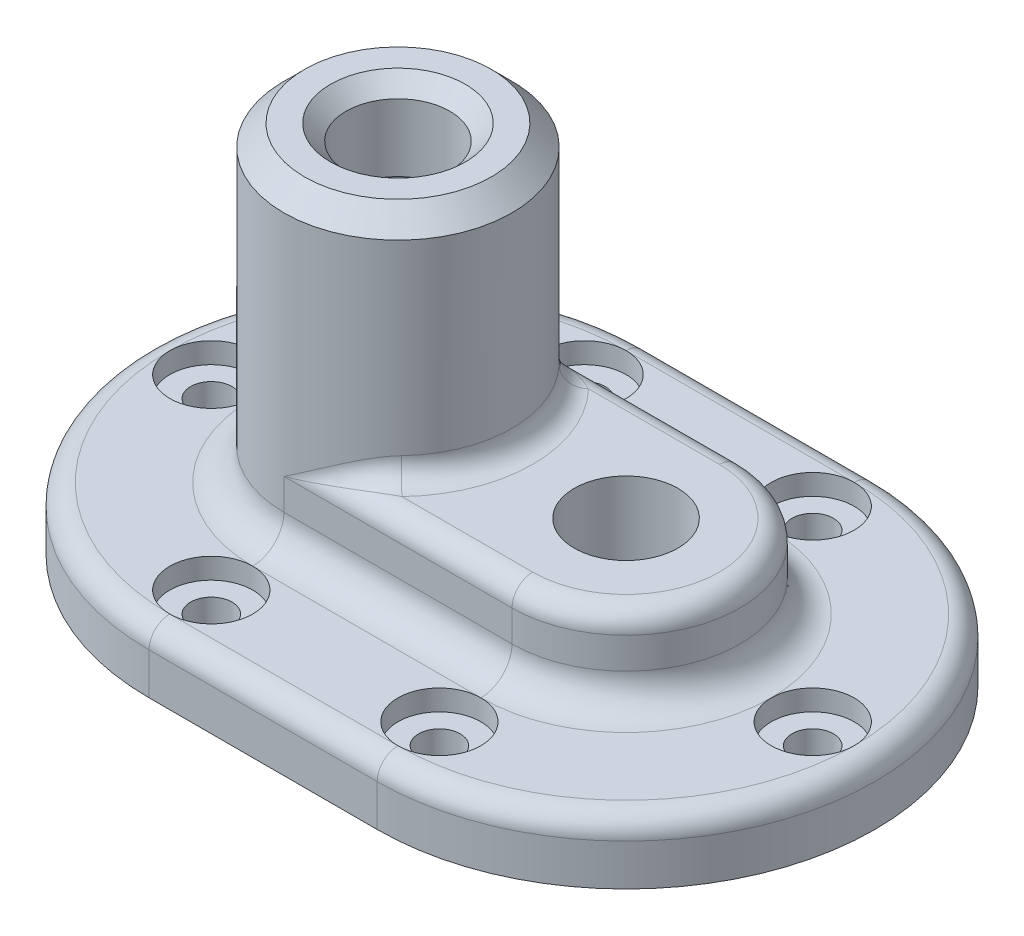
ISO-10303-21;
HEADER;
FILE_DESCRIPTION(('STEP AP214'),'2;1');
FILE_NAME('part.step','',(''),(''),'','','');
FILE_SCHEMA(('AUTOMOTIVE_DESIGN { 1 0 10303 214 1 1 1 1 }'));
ENDSEC;
DATA;
#1=APPLICATION_CONTEXT('core data for automotive mechanical design processes');
#2=APPLICATION_PROTOCOL_DEFINITION('international standard','automotive_design',2000,#1);
#3=PRODUCT_CONTEXT('',#1,'mechanical');
#4=PRODUCT('Part','Part','',(#3));
#5=PRODUCT_RELATED_PRODUCT_CATEGORY('part','',(#4));
#6=PRODUCT_DEFINITION_FORMATION('','',#4);
#7=PRODUCT_DEFINITION_CONTEXT('part definition',#1,'design');
#8=PRODUCT_DEFINITION('design','',#6,#7);
#9=PRODUCT_DEFINITION_SHAPE('','',#8);
#10=(LENGTH_UNIT() NAMED_UNIT(*) SI_UNIT(.MILLI.,.METRE.));
#11=(NAMED_UNIT(*) PLANE_ANGLE_UNIT() SI_UNIT($,.RADIAN.));
#12=(NAMED_UNIT(*) SI_UNIT($,.STERADIAN.) SOLID_ANGLE_UNIT());
#13=UNCERTAINTY_MEASURE_WITH_UNIT(LENGTH_MEASURE(1.E-05),#10,'distance_accuracy_value','');
#14=(GEOMETRIC_REPRESENTATION_CONTEXT(3) GLOBAL_UNCERTAINTY_ASSIGNED_CONTEXT((#13)) GLOBAL_UNIT_ASSIGNED_CONTEXT((#10,
#11,#12)) REPRESENTATION_CONTEXT('',''));
#15=CARTESIAN_POINT('',(0.,0.,0.));
#16=DIRECTION('',(0.,0.,1.));
#17=DIRECTION('',(1.,0.,0.));
#18=AXIS2_PLACEMENT_3D('',#15,#16,#17);
#19=CARTESIAN_POINT('',(0.,12.,0.));
#20=DIRECTION('',(0.,1.,0.));
#21=DIRECTION('',(0.,0.,1.));
#22=AXIS2_PLACEMENT_3D('',#19,#20,#21);
#23=PLANE('',#22);
#24=CARTESIAN_POINT('',(0.,12.,-36.));
#25=DIRECTION('',(0.,1.,0.));
#26=DIRECTION('',(0.,0.,1.));
#27=AXIS2_PLACEMENT_3D('',#24,#25,#26);
#28=CIRCLE('',#27,8.);
#29=CARTESIAN_POINT('',(0.,12.,-28.));
#30=VERTEX_POINT('',#29);
#31=CARTESIAN_POINT('',(0.,12.,-44.));
#32=VERTEX_POINT('',#31);
#33=EDGE_CURVE('E366',#30,#32,#28,.T.);
#34=ORIENTED_EDGE('',*,*,#33,.F.);
#35=DIRECTION('',(-1.,0.,0.));
#36=VECTOR('',#35,1.);
#37=CARTESIAN_POINT('',(0.,12.,-28.));
#38=LINE('',#37,#36);
#39=CARTESIAN_POINT('',(44.,12.,-28.));
#40=VERTEX_POINT('',#39);
#41=EDGE_CURVE('E461',#30,#40,#38,.F.);
#42=ORIENTED_EDGE('',*,*,#41,.T.);
#43=CARTESIAN_POINT('',(44.,12.,-36.));
#44=DIRECTION('',(0.,1.,0.));
#45=DIRECTION('',(0.,0.,1.));
#46=AXIS2_PLACEMENT_3D('',#43,#44,#45);
#47=CIRCLE('',#46,8.);
#48=CARTESIAN_POINT('',(44.,12.,-44.));
#49=VERTEX_POINT('',#48);
#50=EDGE_CURVE('E370',#49,#40,#47,.T.);
#51=ORIENTED_EDGE('',*,*,#50,.F.);
#52=DIRECTION('',(-1.,0.,0.));
#53=VECTOR('',#52,1.);
#54=CARTESIAN_POINT('',(0.,12.,-44.));
#55=LINE('',#54,#53);
#56=EDGE_CURVE('E426',#49,#32,#55,.T.);
#57=ORIENTED_EDGE('',*,*,#56,.T.);
#58=EDGE_LOOP('',(#34,#42,#51,#57));
#59=FACE_BOUND('',#58,.T.);
#60=ADVANCED_FACE('F34',(#59),#23,.T.);
#61=EDGE_CURVE('E374',#40,#49,#47,.T.);
#62=ORIENTED_EDGE('',*,*,#61,.F.);
#63=CARTESIAN_POINT('',(44.,12.,0.));
#64=DIRECTION('',(0.,1.,0.));
#65=DIRECTION('',(0.,0.,1.));
#66=AXIS2_PLACEMENT_3D('',#63,#64,#65);
#67=CIRCLE('',#66,28.);
#68=CARTESIAN_POINT('',(72.,12.,0.));
#69=VERTEX_POINT('',#68);
#70=EDGE_CURVE('E459',#40,#69,#67,.F.);
#71=ORIENTED_EDGE('',*,*,#70,.T.);
#72=CARTESIAN_POINT('',(80.,12.,0.));
#73=DIRECTION('',(0.,1.,0.));
#74=DIRECTION('',(0.,0.,1.));
#75=AXIS2_PLACEMENT_3D('',#72,#73,#74);
#76=CIRCLE('',#75,8.00000000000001);
#77=CARTESIAN_POINT('',(88.,12.,0.));
#78=VERTEX_POINT('',#77);
#79=EDGE_CURVE('E378',#78,#69,#76,.T.);
#80=ORIENTED_EDGE('',*,*,#79,.F.);
#81=CARTESIAN_POINT('',(44.,12.,0.));
#82=DIRECTION('',(0.,1.,0.));
#83=DIRECTION('',(0.,0.,1.));
#84=AXIS2_PLACEMENT_3D('',#81,#82,#83);
#85=CIRCLE('',#84,44.);
#86=EDGE_CURVE('E410',#78,#49,#85,.T.);
#87=ORIENTED_EDGE('',*,*,#86,.T.);
#88=EDGE_LOOP('',(#62,#71,#80,#87));
#89=FACE_BOUND('',#88,.T.);
#90=ADVANCED_FACE('F537',(#89),#23,.T.);
#91=EDGE_CURVE('E382',#69,#78,#76,.T.);
#92=ORIENTED_EDGE('',*,*,#91,.F.);
#93=CARTESIAN_POINT('',(44.,12.,0.));
#94=DIRECTION('',(0.,1.,0.));
#95=DIRECTION('',(0.,0.,1.));
#96=AXIS2_PLACEMENT_3D('',#93,#94,#95);
#97=CIRCLE('',#96,28.);
#98=CARTESIAN_POINT('',(44.,12.,28.));
#99=VERTEX_POINT('',#98);
#100=EDGE_CURVE('E457',#69,#99,#97,.F.);
#101=ORIENTED_EDGE('',*,*,#100,.T.);
#102=CARTESIAN_POINT('',(44.,12.,36.));
#103=DIRECTION('',(0.,1.,0.));
#104=DIRECTION('',(0.,0.,1.));
#105=AXIS2_PLACEMENT_3D('',#102,#103,#104);
#106=CIRCLE('',#105,8.);
#107=CARTESIAN_POINT('',(44.,12.,44.));
#108=VERTEX_POINT('',#107);
#109=EDGE_CURVE('E386',#108,#99,#106,.T.);
#110=ORIENTED_EDGE('',*,*,#109,.F.);
#111=CARTESIAN_POINT('',(44.,12.,0.));
#112=DIRECTION('',(0.,1.,0.));
#113=DIRECTION('',(0.,0.,1.));
#114=AXIS2_PLACEMENT_3D('',#111,#112,#113);
#115=CIRCLE('',#114,44.);
#116=EDGE_CURVE('E413',#108,#78,#115,.T.);
#117=ORIENTED_EDGE('',*,*,#116,.T.);
#118=EDGE_LOOP('',(#92,#101,#110,#117));
#119=FACE_BOUND('',#118,.T.);
#120=ADVANCED_FACE('F583',(#119),#23,.T.);
#121=EDGE_CURVE('E390',#99,#108,#106,.T.);
#122=ORIENTED_EDGE('',*,*,#121,.F.);
#123=DIRECTION('',(1.,0.,0.));
#124=VECTOR('',#123,1.);
#125=CARTESIAN_POINT('',(0.,12.,28.));
#126=LINE('',#125,#124);
#127=CARTESIAN_POINT('',(0.,12.,28.));
#128=VERTEX_POINT('',#127);
#129=EDGE_CURVE('E455',#99,#128,#126,.F.);
#130=ORIENTED_EDGE('',*,*,#129,.T.);
#131=CARTESIAN_POINT('',(0.,12.,36.));
#132=DIRECTION('',(0.,1.,0.));
#133=DIRECTION('',(0.,0.,1.));
#134=AXIS2_PLACEMENT_3D('',#131,#132,#133);
#135=CIRCLE('',#134,8.);
#136=CARTESIAN_POINT('',(0.,12.,44.));
#137=VERTEX_POINT('',#136);
#138=EDGE_CURVE('E394',#137,#128,#135,.T.);
#139=ORIENTED_EDGE('',*,*,#138,.F.);
#140=DIRECTION('',(1.,0.,0.));
#141=VECTOR('',#140,1.);
#142=CARTESIAN_POINT('',(44.,12.,44.));
#143=LINE('',#142,#141);
#144=EDGE_CURVE('E417',#137,#108,#143,.T.);
#145=ORIENTED_EDGE('',*,*,#144,.T.);
#146=EDGE_LOOP('',(#122,#130,#139,#145));
#147=FACE_BOUND('',#146,.T.);
#148=ADVANCED_FACE('F616',(#147),#23,.T.);
#149=EDGE_CURVE('E398',#128,#137,#135,.T.);
#150=ORIENTED_EDGE('',*,*,#149,.F.);
#151=CARTESIAN_POINT('',(0.,12.,0.));
#152=DIRECTION('',(0.,1.,0.));
#153=DIRECTION('',(0.,0.,1.));
#154=AXIS2_PLACEMENT_3D('',#151,#152,#153);
#155=CIRCLE('',#154,28.);
#156=CARTESIAN_POINT('',(-28.,12.,0.));
#157=VERTEX_POINT('',#156);
#158=EDGE_CURVE('E453',#128,#157,#155,.F.);
#159=ORIENTED_EDGE('',*,*,#158,.T.);
#160=CARTESIAN_POINT('',(-36.,12.,0.));
#161=DIRECTION('',(0.,1.,0.));
#162=DIRECTION('',(0.,0.,1.));
#163=AXIS2_PLACEMENT_3D('',#160,#161,#162);
#164=CIRCLE('',#163,8.);
#165=CARTESIAN_POINT('',(-44.,12.,0.));
#166=VERTEX_POINT('',#165);
#167=EDGE_CURVE('E355',#166,#157,#164,.T.);
#168=ORIENTED_EDGE('',*,*,#167,.F.);
#169=CARTESIAN_POINT('',(0.,12.,0.));
#170=DIRECTION('',(0.,1.,0.));
#171=DIRECTION('',(0.,0.,1.));
#172=AXIS2_PLACEMENT_3D('',#169,#170,#171);
#173=CIRCLE('',#172,44.);
#174=EDGE_CURVE('E420',#166,#137,#173,.T.);
#175=ORIENTED_EDGE('',*,*,#174,.T.);
#176=EDGE_LOOP('',(#150,#159,#168,#175));
#177=FACE_BOUND('',#176,.T.);
#178=ADVANCED_FACE('F562',(#177),#23,.T.);
#179=CARTESIAN_POINT('',(0.,72.,36.));
#180=DIRECTION('',(0.,-1.,0.));
#181=DIRECTION('',(0.,0.,-1.));
#182=AXIS2_PLACEMENT_3D('',#179,#180,#181);
#183=CYLINDRICAL_SURFACE('',#182,4.);
#184=CARTESIAN_POINT('',(0.,0.,36.));
#185=DIRECTION('',(0.,1.,0.));
#186=DIRECTION('',(0.,0.,1.));
#187=AXIS2_PLACEMENT_3D('',#184,#185,#186);
#188=CIRCLE('',#187,4.);
#189=CARTESIAN_POINT('',(0.,0.,40.));
#190=VERTEX_POINT('',#189);
#191=EDGE_CURVE('E342',#190,#190,#188,.T.);
#192=ORIENTED_EDGE('',*,*,#191,.F.);
#193=EDGE_LOOP('',(#192));
#194=FACE_BOUND('',#193,.T.);
#195=CARTESIAN_POINT('',(0.,7.99999999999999,36.));
#196=DIRECTION('',(0.,1.,0.));
#197=DIRECTION('',(0.,0.,1.));
#198=AXIS2_PLACEMENT_3D('',#195,#196,#197);
#199=CIRCLE('',#198,4.);
#200=CARTESIAN_POINT('',(0.,7.99999999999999,40.));
#201=VERTEX_POINT('',#200);
#202=EDGE_CURVE('E400',#201,#201,#199,.T.);
#203=ORIENTED_EDGE('',*,*,#202,.T.);
#204=EDGE_LOOP('',(#203));
#205=FACE_BOUND('',#204,.T.);
#206=ADVANCED_FACE('F615',(#194,#205),#183,.F.);
#207=CARTESIAN_POINT('',(44.,72.,36.));
#208=DIRECTION('',(0.,-1.,0.));
#209=DIRECTION('',(0.,0.,-1.));
#210=AXIS2_PLACEMENT_3D('',#207,#208,#209);
#211=CYLINDRICAL_SURFACE('',#210,4.00000000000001);
#212=CARTESIAN_POINT('',(44.,0.,36.));
#213=DIRECTION('',(0.,1.,0.));
#214=DIRECTION('',(0.,0.,1.));
#215=AXIS2_PLACEMENT_3D('',#212,#213,#214);
#216=CIRCLE('',#215,4.00000000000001);
#217=CARTESIAN_POINT('',(44.,0.,40.));
#218=VERTEX_POINT('',#217);
#219=EDGE_CURVE('E351',#218,#218,#216,.T.);
#220=ORIENTED_EDGE('',*,*,#219,.F.);
#221=EDGE_LOOP('',(#220));
#222=FACE_BOUND('',#221,.T.);
#223=CARTESIAN_POINT('',(44.,7.99999999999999,36.));
#224=DIRECTION('',(0.,1.,0.));
#225=DIRECTION('',(0.,0.,1.));
#226=AXIS2_PLACEMENT_3D('',#223,#224,#225);
#227=CIRCLE('',#226,4.00000000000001);
#228=CARTESIAN_POINT('',(44.,7.99999999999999,40.));
#229=VERTEX_POINT('',#228);
#230=EDGE_CURVE('E393',#229,#229,#227,.T.);
#231=ORIENTED_EDGE('',*,*,#230,.T.);
#232=EDGE_LOOP('',(#231));
#233=FACE_BOUND('',#232,.T.);
#234=ADVANCED_FACE('F621',(#222,#233),#211,.F.);
#235=CARTESIAN_POINT('',(80.,72.,0.));
#236=DIRECTION('',(0.,-1.,0.));
#237=DIRECTION('',(0.,0.,-1.));
#238=AXIS2_PLACEMENT_3D('',#235,#236,#237);
#239=CYLINDRICAL_SURFACE('',#238,4.00000000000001);
#240=CARTESIAN_POINT('',(80.,0.,0.));
#241=DIRECTION('',(0.,1.,0.));
#242=DIRECTION('',(0.,0.,1.));
#243=AXIS2_PLACEMENT_3D('',#240,#241,#242);
#244=CIRCLE('',#243,4.00000000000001);
#245=CARTESIAN_POINT('',(80.,0.,4.00000000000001));
#246=VERTEX_POINT('',#245);
#247=EDGE_CURVE('E345',#246,#246,#244,.T.);
#248=ORIENTED_EDGE('',*,*,#247,.F.);
#249=EDGE_LOOP('',(#248));
#250=FACE_BOUND('',#249,.T.);
#251=CARTESIAN_POINT('',(80.,7.99999999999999,0.));
#252=DIRECTION('',(0.,1.,0.));
#253=DIRECTION('',(0.,0.,1.));
#254=AXIS2_PLACEMENT_3D('',#251,#252,#253);
#255=CIRCLE('',#254,4.00000000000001);
#256=CARTESIAN_POINT('',(80.,7.99999999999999,4.00000000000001));
#257=VERTEX_POINT('',#256);
#258=EDGE_CURVE('E385',#257,#257,#255,.T.);
#259=ORIENTED_EDGE('',*,*,#258,.T.);
#260=EDGE_LOOP('',(#259));
#261=FACE_BOUND('',#260,.T.);
#262=ADVANCED_FACE('F872',(#250,#261),#239,.F.);
#263=CARTESIAN_POINT('',(44.,72.,-36.));
#264=DIRECTION('',(0.,-1.,0.));
#265=DIRECTION('',(0.,0.,-1.));
#266=AXIS2_PLACEMENT_3D('',#263,#264,#265);
#267=CYLINDRICAL_SURFACE('',#266,4.00000000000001);
#268=CARTESIAN_POINT('',(44.,0.,-36.));
#269=DIRECTION('',(0.,1.,0.));
#270=DIRECTION('',(0.,0.,1.));
#271=AXIS2_PLACEMENT_3D('',#268,#269,#270);
#272=CIRCLE('',#271,4.00000000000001);
#273=CARTESIAN_POINT('',(44.,0.,-32.));
#274=VERTEX_POINT('',#273);
#275=EDGE_CURVE('E348',#274,#274,#272,.T.);
#276=ORIENTED_EDGE('',*,*,#275,.F.);
#277=EDGE_LOOP('',(#276));
#278=FACE_BOUND('',#277,.T.);
#279=CARTESIAN_POINT('',(44.,7.99999999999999,-36.));
#280=DIRECTION('',(0.,1.,0.));
#281=DIRECTION('',(0.,0.,1.));
#282=AXIS2_PLACEMENT_3D('',#279,#280,#281);
#283=CIRCLE('',#282,4.00000000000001);
#284=CARTESIAN_POINT('',(44.,7.99999999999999,-32.));
#285=VERTEX_POINT('',#284);
#286=EDGE_CURVE('E377',#285,#285,#283,.T.);
#287=ORIENTED_EDGE('',*,*,#286,.T.);
#288=EDGE_LOOP('',(#287));
#289=FACE_BOUND('',#288,.T.);
#290=ADVANCED_FACE('F881',(#278,#289),#267,.F.);
#291=CARTESIAN_POINT('',(0.,72.,-36.));
#292=DIRECTION('',(0.,-1.,0.));
#293=DIRECTION('',(0.,0.,-1.));
#294=AXIS2_PLACEMENT_3D('',#291,#292,#293);
#295=CYLINDRICAL_SURFACE('',#294,4.);
#296=CARTESIAN_POINT('',(0.,0.,-36.));
#297=DIRECTION('',(0.,1.,0.));
#298=DIRECTION('',(0.,0.,1.));
#299=AXIS2_PLACEMENT_3D('',#296,#297,#298);
#300=CIRCLE('',#299,4.);
#301=CARTESIAN_POINT('',(0.,0.,-32.));
#302=VERTEX_POINT('',#301);
#303=EDGE_CURVE('E336',#302,#302,#300,.T.);
#304=ORIENTED_EDGE('',*,*,#303,.F.);
#305=EDGE_LOOP('',(#304));
#306=FACE_BOUND('',#305,.T.);
#307=CARTESIAN_POINT('',(0.,7.99999999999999,-36.));
#308=DIRECTION('',(0.,1.,0.));
#309=DIRECTION('',(0.,0.,1.));
#310=AXIS2_PLACEMENT_3D('',#307,#308,#309);
#311=CIRCLE('',#310,4.);
#312=CARTESIAN_POINT('',(0.,7.99999999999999,-32.));
#313=VERTEX_POINT('',#312);
#314=EDGE_CURVE('E369',#313,#313,#311,.T.);
#315=ORIENTED_EDGE('',*,*,#314,.T.);
#316=EDGE_LOOP('',(#315));
#317=FACE_BOUND('',#316,.T.);
#318=ADVANCED_FACE('F890',(#306,#317),#295,.F.);
#319=CARTESIAN_POINT('',(-36.,72.,0.));
#320=DIRECTION('',(0.,-1.,0.));
#321=DIRECTION('',(0.,0.,-1.));
#322=AXIS2_PLACEMENT_3D('',#319,#320,#321);
#323=CYLINDRICAL_SURFACE('',#322,4.);
#324=CARTESIAN_POINT('',(-36.,0.,0.));
#325=DIRECTION('',(0.,1.,0.));
#326=DIRECTION('',(0.,0.,1.));
#327=AXIS2_PLACEMENT_3D('',#324,#325,#326);
#328=CIRCLE('',#327,4.);
#329=CARTESIAN_POINT('',(-36.,0.,4.));
#330=VERTEX_POINT('',#329);
#331=EDGE_CURVE('E339',#330,#330,#328,.T.);
#332=ORIENTED_EDGE('',*,*,#331,.F.);
#333=EDGE_LOOP('',(#332));
#334=FACE_BOUND('',#333,.T.);
#335=CARTESIAN_POINT('',(-36.,7.99999999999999,0.));
#336=DIRECTION('',(0.,1.,0.));
#337=DIRECTION('',(0.,0.,1.));
#338=AXIS2_PLACEMENT_3D('',#335,#336,#337);
#339=CIRCLE('',#338,4.);
#340=CARTESIAN_POINT('',(-36.,7.99999999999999,4.));
#341=VERTEX_POINT('',#340);
#342=EDGE_CURVE('E354',#341,#341,#339,.T.);
#343=ORIENTED_EDGE('',*,*,#342,.T.);
#344=EDGE_LOOP('',(#343));
#345=FACE_BOUND('',#344,.T.);
#346=ADVANCED_FACE('F612',(#334,#345),#323,.F.);
#347=CARTESIAN_POINT('',(0.,0.,0.));
#348=DIRECTION('',(0.,1.,0.));
#349=DIRECTION('',(0.,0.,1.));
#350=AXIS2_PLACEMENT_3D('',#347,#348,#349);
#351=PLANE('',#350);
#352=ORIENTED_EDGE('',*,*,#275,.T.);
#353=EDGE_LOOP('',(#352));
#354=FACE_BOUND('',#353,.T.);
#355=ORIENTED_EDGE('',*,*,#191,.T.);
#356=EDGE_LOOP('',(#355));
#357=FACE_BOUND('',#356,.T.);
#358=ORIENTED_EDGE('',*,*,#303,.T.);
#359=EDGE_LOOP('',(#358));
#360=FACE_BOUND('',#359,.T.);
#361=CARTESIAN_POINT('',(44.,0.,0.));
#362=DIRECTION('',(0.,1.,0.));
#363=DIRECTION('',(0.,0.,1.));
#364=AXIS2_PLACEMENT_3D('',#361,#362,#363);
#365=CIRCLE('',#364,12.9999999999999);
#366=CARTESIAN_POINT('',(44.,0.,12.9999999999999));
#367=VERTEX_POINT('',#366);
#368=EDGE_CURVE('E517',#367,#367,#365,.T.);
#369=ORIENTED_EDGE('',*,*,#368,.T.);
#370=EDGE_LOOP('',(#369));
#371=FACE_BOUND('',#370,.T.);
#372=CARTESIAN_POINT('',(0.,0.,0.));
#373=DIRECTION('',(0.,1.,0.));
#374=DIRECTION('',(0.,0.,1.));
#375=AXIS2_PLACEMENT_3D('',#372,#373,#374);
#376=CIRCLE('',#375,13.);
#377=CARTESIAN_POINT('',(0.,0.,13.));
#378=VERTEX_POINT('',#377);
#379=EDGE_CURVE('E511',#378,#378,#376,.T.);
#380=ORIENTED_EDGE('',*,*,#379,.T.);
#381=EDGE_LOOP('',(#380));
#382=FACE_BOUND('',#381,.T.);
#383=CARTESIAN_POINT('',(0.,0.,0.));
#384=DIRECTION('',(0.,1.,0.));
#385=DIRECTION('',(0.,0.,1.));
#386=AXIS2_PLACEMENT_3D('',#383,#384,#385);
#387=CIRCLE('',#386,48.);
#388=CARTESIAN_POINT('',(0.,0.,-48.));
#389=VERTEX_POINT('',#388);
#390=CARTESIAN_POINT('',(0.,0.,48.));
#391=VERTEX_POINT('',#390);
#392=EDGE_CURVE('E176',#389,#391,#387,.T.);
#393=ORIENTED_EDGE('',*,*,#392,.F.);
#394=DIRECTION('',(-1.,0.,0.));
#395=VECTOR('',#394,1.);
#396=CARTESIAN_POINT('',(0.,0.,-48.));
#397=LINE('',#396,#395);
#398=CARTESIAN_POINT('',(44.,0.,-48.));
#399=VERTEX_POINT('',#398);
#400=EDGE_CURVE('E192',#399,#389,#397,.T.);
#401=ORIENTED_EDGE('',*,*,#400,.F.);
#402=CARTESIAN_POINT('',(44.,0.,0.));
#403=DIRECTION('',(0.,1.,0.));
#404=DIRECTION('',(0.,0.,1.));
#405=AXIS2_PLACEMENT_3D('',#402,#403,#404);
#406=CIRCLE('',#405,48.);
#407=CARTESIAN_POINT('',(44.,0.,48.));
#408=VERTEX_POINT('',#407);
#409=EDGE_CURVE('E178',#408,#399,#406,.T.);
#410=ORIENTED_EDGE('',*,*,#409,.F.);
#411=DIRECTION('',(1.,0.,0.));
#412=VECTOR('',#411,1.);
#413=CARTESIAN_POINT('',(0.,0.,48.));
#414=LINE('',#413,#412);
#415=EDGE_CURVE('E161',#391,#408,#414,.T.);
#416=ORIENTED_EDGE('',*,*,#415,.F.);
#417=EDGE_LOOP('',(#393,#401,#410,#416));
#418=FACE_BOUND('',#417,.T.);
#419=ORIENTED_EDGE('',*,*,#331,.T.);
#420=EDGE_LOOP('',(#419));
#421=FACE_BOUND('',#420,.T.);
#422=ORIENTED_EDGE('',*,*,#247,.T.);
#423=EDGE_LOOP('',(#422));
#424=FACE_BOUND('',#423,.T.);
#425=ORIENTED_EDGE('',*,*,#219,.T.);
#426=EDGE_LOOP('',(#425));
#427=FACE_BOUND('',#426,.T.);
#428=ADVANCED_FACE('F173',(#354,#357,#360,#371,#382,#418,#421,#424,#427),#351,.F.);
#429=EDGE_CURVE('E359',#157,#166,#164,.T.);
#430=ORIENTED_EDGE('',*,*,#429,.F.);
#431=CARTESIAN_POINT('',(0.,12.,0.));
#432=DIRECTION('',(0.,1.,0.));
#433=DIRECTION('',(0.,0.,1.));
#434=AXIS2_PLACEMENT_3D('',#431,#432,#433);
#435=CIRCLE('',#434,28.);
#436=EDGE_CURVE('E451',#157,#30,#435,.F.);
#437=ORIENTED_EDGE('',*,*,#436,.T.);
#438=EDGE_CURVE('E362',#32,#30,#28,.T.);
#439=ORIENTED_EDGE('',*,*,#438,.F.);
#440=CARTESIAN_POINT('',(0.,12.,0.));
#441=DIRECTION('',(0.,1.,0.));
#442=DIRECTION('',(0.,0.,1.));
#443=AXIS2_PLACEMENT_3D('',#440,#441,#442);
#444=CIRCLE('',#443,44.);
#445=EDGE_CURVE('E423',#32,#166,#444,.T.);
#446=ORIENTED_EDGE('',*,*,#445,.T.);
#447=EDGE_LOOP('',(#430,#437,#439,#446));
#448=FACE_BOUND('',#447,.T.);
#449=ADVANCED_FACE('F494',(#448),#23,.T.);
#450=CARTESIAN_POINT('',(0.,28.,0.));
#451=DIRECTION('',(0.,1.,0.));
#452=DIRECTION('',(0.,0.,1.));
#453=AXIS2_PLACEMENT_3D('',#450,#451,#452);
#454=PLANE('',#453);
#455=DIRECTION('',(-1.,0.,0.));
#456=VECTOR('',#455,1.);
#457=CARTESIAN_POINT('',(0.,28.,-18.));
#458=LINE('',#457,#456);
#459=CARTESIAN_POINT('',(44.,28.,-18.));
#460=VERTEX_POINT('',#459);
#461=CARTESIAN_POINT('',(18.7616630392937,28.,-18.));
#462=VERTEX_POINT('',#461);
#463=EDGE_CURVE('E481',#460,#462,#458,.T.);
#464=ORIENTED_EDGE('',*,*,#463,.T.);
#465=CARTESIAN_POINT('',(0.,28.,0.));
#466=DIRECTION('',(0.,1.,0.));
#467=DIRECTION('',(0.,0.,1.));
#468=AXIS2_PLACEMENT_3D('',#465,#466,#467);
#469=CIRCLE('',#468,26.);
#470=CARTESIAN_POINT('',(18.7616630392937,28.,18.));
#471=VERTEX_POINT('',#470);
#472=EDGE_CURVE('E11',#462,#471,#469,.F.);
#473=ORIENTED_EDGE('',*,*,#472,.T.);
#474=DIRECTION('',(1.,0.,0.));
#475=VECTOR('',#474,1.);
#476=CARTESIAN_POINT('',(44.,28.,18.));
#477=LINE('',#476,#475);
#478=CARTESIAN_POINT('',(44.,28.,18.));
#479=VERTEX_POINT('',#478);
#480=EDGE_CURVE('E307',#471,#479,#477,.T.);
#481=ORIENTED_EDGE('',*,*,#480,.T.);
#482=CARTESIAN_POINT('',(44.,28.,0.));
#483=DIRECTION('',(0.,1.,0.));
#484=DIRECTION('',(0.,0.,1.));
#485=AXIS2_PLACEMENT_3D('',#482,#483,#484);
#486=CIRCLE('',#485,18.);
#487=EDGE_CURVE('E469',#479,#460,#486,.T.);
#488=ORIENTED_EDGE('',*,*,#487,.T.);
#489=EDGE_LOOP('',(#464,#473,#481,#488));
#490=FACE_BOUND('',#489,.T.);
#491=CARTESIAN_POINT('',(44.,28.,0.));
#492=DIRECTION('',(0.,1.,0.));
#493=DIRECTION('',(0.,0.,1.));
#494=AXIS2_PLACEMENT_3D('',#491,#492,#493);
#495=CIRCLE('',#494,10.);
#496=CARTESIAN_POINT('',(44.,28.,-10.));
#497=VERTEX_POINT('',#496);
#498=EDGE_CURVE('E335',#497,#497,#495,.F.);
#499=ORIENTED_EDGE('',*,*,#498,.T.);
#500=EDGE_LOOP('',(#499));
#501=FACE_BOUND('',#500,.T.);
#502=ADVANCED_FACE('F491',(#490,#501),#454,.T.);
#503=CARTESIAN_POINT('',(0.,12.,0.));
#504=DIRECTION('',(0.,-1.,0.));
#505=DIRECTION('',(0.,0.,-1.));
#506=AXIS2_PLACEMENT_3D('',#503,#504,#505);
#507=CYLINDRICAL_SURFACE('',#506,48.);
#508=DIRECTION('',(0.,-1.,0.));
#509=VECTOR('',#508,1.);
#510=CARTESIAN_POINT('',(0.,12.,48.));
#511=LINE('',#510,#509);
#512=CARTESIAN_POINT('',(0.,8.,48.));
#513=VERTEX_POINT('',#512);
#514=EDGE_CURVE('E157',#513,#391,#511,.T.);
#515=ORIENTED_EDGE('',*,*,#514,.F.);
#516=CARTESIAN_POINT('',(0.,8.,0.));
#517=DIRECTION('',(0.,1.,0.));
#518=DIRECTION('',(0.,0.,1.));
#519=AXIS2_PLACEMENT_3D('',#516,#517,#518);
#520=CIRCLE('',#519,48.);
#521=CARTESIAN_POINT('',(0.,8.,-48.));
#522=VERTEX_POINT('',#521);
#523=EDGE_CURVE('E432',#513,#522,#520,.F.);
#524=ORIENTED_EDGE('',*,*,#523,.T.);
#525=DIRECTION('',(0.,-1.,0.));
#526=VECTOR('',#525,1.);
#527=CARTESIAN_POINT('',(0.,12.,-48.));
#528=LINE('',#527,#526);
#529=EDGE_CURVE('E182',#522,#389,#528,.T.);
#530=ORIENTED_EDGE('',*,*,#529,.T.);
#531=ORIENTED_EDGE('',*,*,#392,.T.);
#532=EDGE_LOOP('',(#515,#524,#530,#531));
#533=FACE_BOUND('',#532,.T.);
#534=ADVANCED_FACE('F180',(#533),#507,.T.);
#535=CARTESIAN_POINT('',(0.,12.,48.));
#536=DIRECTION('',(0.,0.,-1.));
#537=DIRECTION('',(-1.,0.,0.));
#538=AXIS2_PLACEMENT_3D('',#535,#536,#537);
#539=PLANE('',#538);
#540=DIRECTION('',(0.,-1.,0.));
#541=VECTOR('',#540,1.);
#542=CARTESIAN_POINT('',(44.,12.,48.));
#543=LINE('',#542,#541);
#544=CARTESIAN_POINT('',(44.,8.,48.));
#545=VERTEX_POINT('',#544);
#546=EDGE_CURVE('E169',#545,#408,#543,.T.);
#547=ORIENTED_EDGE('',*,*,#546,.F.);
#548=DIRECTION('',(1.,0.,0.));
#549=VECTOR('',#548,1.);
#550=CARTESIAN_POINT('',(0.,8.,48.));
#551=LINE('',#550,#549);
#552=EDGE_CURVE('E164',#545,#513,#551,.F.);
#553=ORIENTED_EDGE('',*,*,#552,.T.);
#554=ORIENTED_EDGE('',*,*,#514,.T.);
#555=ORIENTED_EDGE('',*,*,#415,.T.);
#556=EDGE_LOOP('',(#547,#553,#554,#555));
#557=FACE_BOUND('',#556,.T.);
#558=ADVANCED_FACE('F160',(#557),#539,.F.);
#559=CARTESIAN_POINT('',(44.,12.,0.));
#560=DIRECTION('',(0.,-1.,0.));
#561=DIRECTION('',(0.,0.,-1.));
#562=AXIS2_PLACEMENT_3D('',#559,#560,#561);
#563=CYLINDRICAL_SURFACE('',#562,48.);
#564=DIRECTION('',(0.,-1.,0.));
#565=VECTOR('',#564,1.);
#566=CARTESIAN_POINT('',(44.,12.,-48.));
#567=LINE('',#566,#565);
#568=CARTESIAN_POINT('',(44.,8.,-48.));
#569=VERTEX_POINT('',#568);
#570=EDGE_CURVE('E195',#569,#399,#567,.T.);
#571=ORIENTED_EDGE('',*,*,#570,.F.);
#572=CARTESIAN_POINT('',(44.,8.,0.));
#573=DIRECTION('',(0.,1.,0.));
#574=DIRECTION('',(0.,0.,1.));
#575=AXIS2_PLACEMENT_3D('',#572,#573,#574);
#576=CIRCLE('',#575,48.);
#577=EDGE_CURVE('E435',#569,#545,#576,.F.);
#578=ORIENTED_EDGE('',*,*,#577,.T.);
#579=ORIENTED_EDGE('',*,*,#546,.T.);
#580=ORIENTED_EDGE('',*,*,#409,.T.);
#581=EDGE_LOOP('',(#571,#578,#579,#580));
#582=FACE_BOUND('',#581,.T.);
#583=ADVANCED_FACE('F1069',(#582),#563,.T.);
#584=CARTESIAN_POINT('',(0.,12.,-48.));
#585=DIRECTION('',(0.,0.,1.));
#586=DIRECTION('',(1.,0.,0.));
#587=AXIS2_PLACEMENT_3D('',#584,#585,#586);
#588=PLANE('',#587);
#589=ORIENTED_EDGE('',*,*,#529,.F.);
#590=DIRECTION('',(-1.,0.,0.));
#591=VECTOR('',#590,1.);
#592=CARTESIAN_POINT('',(44.,8.,-48.));
#593=LINE('',#592,#591);
#594=EDGE_CURVE('E429',#522,#569,#593,.F.);
#595=ORIENTED_EDGE('',*,*,#594,.T.);
#596=ORIENTED_EDGE('',*,*,#570,.T.);
#597=ORIENTED_EDGE('',*,*,#400,.T.);
#598=EDGE_LOOP('',(#589,#595,#596,#597));
#599=FACE_BOUND('',#598,.T.);
#600=ADVANCED_FACE('F1023',(#599),#588,.F.);
#601=CARTESIAN_POINT('',(0.,28.,0.));
#602=DIRECTION('',(0.,-1.,0.));
#603=DIRECTION('',(0.,0.,-1.));
#604=AXIS2_PLACEMENT_3D('',#601,#602,#603);
#605=CYLINDRICAL_SURFACE('',#604,22.);
#606=DIRECTION('',(0.,-1.,0.));
#607=VECTOR('',#606,1.);
#608=CARTESIAN_POINT('',(0.,28.,22.));
#609=LINE('',#608,#607);
#610=CARTESIAN_POINT('',(0.,24.,22.));
#611=VERTEX_POINT('',#610);
#612=CARTESIAN_POINT('',(0.,18.,22.));
#613=VERTEX_POINT('',#612);
#614=EDGE_CURVE('E184',#611,#613,#609,.T.);
#615=ORIENTED_EDGE('',*,*,#614,.F.);
#616=CARTESIAN_POINT('',(21.3075327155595,27.6873310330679,16.4496484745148));
#617=CARTESIAN_POINT('',(17.0934791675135,26.634508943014,13.9456334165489));
#618=CARTESIAN_POINT('',(18.0294507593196,31.3746620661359,12.6070974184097));
#619=CARTESIAN_POINT('',(21.1218016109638,27.7432091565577,16.5825372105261));
#620=CARTESIAN_POINT('',(17.0269250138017,26.7649296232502,14.0054631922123));
#621=CARTESIAN_POINT('',(17.8722936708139,31.4864183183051,12.8319860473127));
#622=CARTESIAN_POINT('',(20.927866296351,27.7908047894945,16.7158414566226));
#623=CARTESIAN_POINT('',(16.9520131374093,26.8961362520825,14.0797886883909));
#624=CARTESIAN_POINT('',(17.7081945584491,31.5816095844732,13.0575778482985));
#625=CARTESIAN_POINT('',(20.525763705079,27.8705710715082,16.9812646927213));
#626=CARTESIAN_POINT('',(16.7843716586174,27.1510380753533,14.2540858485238));
#627=CARTESIAN_POINT('',(17.3679539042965,31.7411421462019,13.5067556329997));
#628=CARTESIAN_POINT('',(20.3176268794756,27.9027736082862,17.1133855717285));
#629=CARTESIAN_POINT('',(16.6921828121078,27.2746812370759,14.3533367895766));
#630=CARTESIAN_POINT('',(17.1918381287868,31.8055472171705,13.7303448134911));
#631=CARTESIAN_POINT('',(19.8910599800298,27.952816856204,17.3734387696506));
#632=CARTESIAN_POINT('',(16.4896492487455,27.5078239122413,14.5731448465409));
#633=CARTESIAN_POINT('',(16.8308969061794,31.905633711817,14.170434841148));
#634=CARTESIAN_POINT('',(19.6727816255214,27.9708236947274,17.5014022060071));
#635=CARTESIAN_POINT('',(16.3800615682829,27.6175784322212,14.6928288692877));
#636=CARTESIAN_POINT('',(16.6461998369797,31.9416473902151,14.3869883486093));
#637=CARTESIAN_POINT('',(19.2251524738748,27.9944189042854,17.7536747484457));
#638=CARTESIAN_POINT('',(16.1419482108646,27.8208481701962,14.9496144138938));
#639=CARTESIAN_POINT('',(16.2674367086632,31.9888378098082,14.8139111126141));
#640=CARTESIAN_POINT('',(18.9957947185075,27.9999993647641,17.87798147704));
#641=CARTESIAN_POINT('',(16.0138782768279,27.9146316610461,15.0862854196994));
#642=CARTESIAN_POINT('',(16.0733647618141,31.99999872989,15.024276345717));
#643=CARTESIAN_POINT('',(18.4612486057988,28.0000008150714,18.1565620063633));
#644=CARTESIAN_POINT('',(15.7016143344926,28.1069307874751,15.4117469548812));
#645=CARTESIAN_POINT('',(15.6210565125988,32.0000016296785,15.4957203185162));
#646=CARTESIAN_POINT('',(18.1529746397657,27.990815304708,18.3093568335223));
#647=CARTESIAN_POINT('',(15.5113669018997,28.2006874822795,15.6050326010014));
#648=CARTESIAN_POINT('',(15.3602093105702,31.9816306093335,15.7542961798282));
#649=CARTESIAN_POINT('',(17.523474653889,27.9566234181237,18.6061854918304));
#650=CARTESIAN_POINT('',(15.1035857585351,28.3555696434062,16.0028541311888));
#651=CARTESIAN_POINT('',(14.8275554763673,31.9132468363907,16.2566216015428));
#652=CARTESIAN_POINT('',(17.202246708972,27.9316146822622,18.7502180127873));
#653=CARTESIAN_POINT('',(14.8866960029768,28.4175391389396,16.2071509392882));
#654=CARTESIAN_POINT('',(14.5557472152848,31.8632293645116,16.500368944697));
#655=CARTESIAN_POINT('',(16.5474345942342,27.8678967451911,19.0295634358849));
#656=CARTESIAN_POINT('',(14.4279846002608,28.509807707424,16.620014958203));
#657=CARTESIAN_POINT('',(14.0016754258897,31.7357934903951,16.9731073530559));
#658=CARTESIAN_POINT('',(16.2137963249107,27.8291191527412,19.1648287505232));
#659=CARTESIAN_POINT('',(14.1864426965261,28.5407607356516,16.8286821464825));
#660=CARTESIAN_POINT('',(13.7193661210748,31.6582383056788,17.2020178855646));
#661=CARTESIAN_POINT('',(15.5375010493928,27.7398918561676,19.4255519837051));
#662=CARTESIAN_POINT('',(13.6828176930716,28.5726603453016,17.2431110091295));
#663=CARTESIAN_POINT('',(13.1471162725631,31.4797837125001,17.6432418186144));
#664=CARTESIAN_POINT('',(15.194841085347,27.68943828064,19.5510066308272));
#665=CARTESIAN_POINT('',(13.4209440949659,28.5742915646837,17.4491418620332));
#666=CARTESIAN_POINT('',(12.8571732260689,31.3788765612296,17.8555496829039));
#667=CARTESIAN_POINT('',(14.337344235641,27.5522463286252,19.8492865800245));
#668=CARTESIAN_POINT('',(12.7545798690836,28.5448101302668,17.9473126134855));
#669=CARTESIAN_POINT('',(12.1315989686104,31.1044926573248,18.360331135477));
#670=CARTESIAN_POINT('',(13.8180994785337,27.4596610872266,20.0162775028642));
#671=CARTESIAN_POINT('',(12.3366182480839,28.499008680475,18.2385884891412));
#672=CARTESIAN_POINT('',(11.6922380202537,30.9193221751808,18.6429311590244));
#673=CARTESIAN_POINT('',(12.7672307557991,27.25746647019,20.3288574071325));
#674=CARTESIAN_POINT('',(11.4720987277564,28.3577084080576,18.7943508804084));
#675=CARTESIAN_POINT('',(10.8030414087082,30.5149329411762,19.1719125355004));
#676=CARTESIAN_POINT('',(12.2356012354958,27.1478493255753,20.4744365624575));
#677=CARTESIAN_POINT('',(11.0250276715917,28.2633054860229,19.060350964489));
#678=CARTESIAN_POINT('',(10.353201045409,30.2956986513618,19.418277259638));
#679=CARTESIAN_POINT('',(11.1625310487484,26.9151380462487,20.7447764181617));
#680=CARTESIAN_POINT('',(10.1092780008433,28.0343737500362,19.5601632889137));
#681=CARTESIAN_POINT('',(9.44521857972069,29.830276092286,19.8757754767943));
#682=CARTESIAN_POINT('',(10.6210827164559,26.7920329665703,20.8695200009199));
#683=CARTESIAN_POINT('',(9.63966392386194,27.9003770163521,19.7954562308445));
#684=CARTESIAN_POINT('',(8.98706999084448,29.5840659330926,20.0868800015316));
#685=CARTESIAN_POINT('',(9.53112825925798,26.5353692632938,21.0986275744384));
#686=CARTESIAN_POINT('',(8.68487361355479,27.6007837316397,20.2306702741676));
#687=CARTESIAN_POINT('',(8.06480083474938,29.0707385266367,20.4746005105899));
#688=CARTESIAN_POINT('',(8.98262280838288,26.401811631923,21.2029934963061));
#689=CARTESIAN_POINT('',(8.19852084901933,27.4353328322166,20.4319459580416));
#690=CARTESIAN_POINT('',(7.60068083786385,28.8036232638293,20.6512197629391));
#691=CARTESIAN_POINT('',(7.7409352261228,26.0918576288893,21.4158214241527));
#692=CARTESIAN_POINT('',(7.09242747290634,27.0359525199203,20.8430769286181));
#693=CARTESIAN_POINT('',(6.55002211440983,28.1837152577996,21.0113901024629));
#694=CARTESIAN_POINT('',(7.0461784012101,25.9131569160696,21.5186690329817));
#695=CARTESIAN_POINT('',(6.46485776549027,26.7939755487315,21.0453061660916));
#696=CARTESIAN_POINT('',(5.96215095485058,27.826313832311,21.1854399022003));
#697=CARTESIAN_POINT('',(5.65093295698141,25.5469725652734,21.6943403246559));
#698=CARTESIAN_POINT('',(5.19931573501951,26.2839524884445,21.3908968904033));
#699=CARTESIAN_POINT('',(4.78155865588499,27.0939451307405,21.4827297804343));
#700=CARTESIAN_POINT('',(4.9504423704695,25.3594857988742,21.7671532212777));
#701=CARTESIAN_POINT('',(4.55845267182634,26.0150492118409,21.5359160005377));
#702=CARTESIAN_POINT('',(4.18883585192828,26.718971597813,21.6059516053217));
#703=CARTESIAN_POINT('',(2.84629633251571,24.7894396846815,21.9413657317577));
#704=CARTESIAN_POINT('',(2.63954665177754,25.189372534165,21.8798504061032));
#705=CARTESIAN_POINT('',(2.40840458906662,25.5788793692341,21.9007727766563));
#706=CARTESIAN_POINT('',(1.4358609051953,24.398236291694,21.9992293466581));
#707=CARTESIAN_POINT('',(1.32549039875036,24.5973887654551,21.9984432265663));
#708=CARTESIAN_POINT('',(1.21495922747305,24.7964725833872,21.99869581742));
#709=CARTESIAN_POINT('',(0.0188005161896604,24.0052143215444,21.9999974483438));
#710=CARTESIAN_POINT('',(0.0173543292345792,24.0078214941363,21.9999949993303));
#711=CARTESIAN_POINT('',(0.0159081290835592,24.0104286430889,21.9999956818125));
#712=CARTESIAN_POINT('',(0.00940019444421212,24.0026071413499,21.999999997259));
#713=CARTESIAN_POINT('',(0.00867710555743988,24.0039107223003,22.0000000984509));
#714=CARTESIAN_POINT('',(0.00795401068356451,24.0052142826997,21.9999999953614));
#715=CARTESIAN_POINT('',(0.,24.,22.));
#716=CARTESIAN_POINT('',(0.,24.,22.));
#717=CARTESIAN_POINT('',(0.,24.,22.));
#718=(BOUNDED_SURFACE() B_SPLINE_SURFACE(3,2,((#616,#617,#618),(#619,#620,#621),(#622,#623,
#624),(#625,#626,#627),(#628,#629,#630),(#631,#632,#633),(#634,#635,#636),(#637,#638,#639),
(#640,#641,#642),(#643,#644,#645),(#646,#647,#648),(#649,#650,#651),(#652,#653,#654),(#655,#656,
#657),(#658,#659,#660),(#661,#662,#663),(#664,#665,#666),(#667,#668,#669),(#670,#671,#672),
(#673,#674,#675),(#676,#677,#678),(#679,#680,#681),(#682,#683,#684),(#685,#686,#687),(#688,#689,
#690),(#691,#692,#693),(#694,#695,#696),(#697,#698,#699),(#700,#701,#702),(#703,#704,#705),
(#706,#707,#708),(#709,#710,#711),(#712,#713,#714),(#715,#716,#717)),.UNSPECIFIED.,.F.,.F.,
.F.) B_SPLINE_SURFACE_WITH_KNOTS((4,2,2,2,2,2,2,2,2,2,2,2,2,2,2,2,4),(3,3),(0.,1.02794424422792,
2.05374971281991,3.0673645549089,4.08162447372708,5.38302170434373,6.68461305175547,
7.99276211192,9.30134553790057,11.2320475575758,13.1636328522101,15.0967973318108,
17.0297785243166,19.4506258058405,21.8723417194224,26.7014398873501,26.7336889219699),(0.,1.),
.UNSPECIFIED.) GEOMETRIC_REPRESENTATION_ITEM() RATIONAL_B_SPLINE_SURFACE(((1.,0.623655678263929,
1.),(1.,0.629694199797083,1.),(1.,0.63608195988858,1.),(1.,0.64938125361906,1.),(1.,
0.656291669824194,1.),(1.,0.670403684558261,1.),(1.,0.67760084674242,1.),(1.,0.692219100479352,
1.),(1.,0.699640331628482,1.),(1.,0.716686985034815,1.),(1.,0.726341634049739,1.),(1.,
0.745568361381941,1.),(1.,0.755140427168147,1.),(1.,0.774074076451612,1.),(1.,0.783434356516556,
1.),(1.,0.801764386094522,1.),(1.,0.810734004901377,1.),(1.,0.832333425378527,1.),(1.,
0.844676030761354,1.),(1.,0.868094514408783,1.),(1.,0.879169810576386,1.),(1.,0.899945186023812,
1.),(1.,0.909644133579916,1.),(1.,0.927592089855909,1.),(1.,0.935841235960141,1.),(1.,
0.952756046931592,1.),(1.,0.961001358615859,1.),(1.,0.975146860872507,1.),(1.,0.981046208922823,
1.),(1.,0.995190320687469,1.),(1.,0.999936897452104,1.),(1.,0.99999979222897,1.),(1.,
1.00000000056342,1.),(1.,1.,1.))) REPRESENTATION_ITEM('') SURFACE());
#719=CARTESIAN_POINT('',(18.0294507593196,31.3746620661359,12.6070974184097));
#720=CARTESIAN_POINT('',(17.8722936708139,31.4864183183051,12.8319860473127));
#721=CARTESIAN_POINT('',(17.7081945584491,31.5816095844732,13.0575778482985));
#722=CARTESIAN_POINT('',(17.3679539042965,31.7411421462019,13.5067556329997));
#723=CARTESIAN_POINT('',(17.1918381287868,31.8055472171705,13.7303448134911));
#724=CARTESIAN_POINT('',(16.8308969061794,31.905633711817,14.170434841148));
#725=CARTESIAN_POINT('',(16.6461998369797,31.9416473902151,14.3869883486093));
#726=CARTESIAN_POINT('',(16.2674367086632,31.9888378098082,14.8139111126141));
#727=CARTESIAN_POINT('',(16.0733647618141,31.99999872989,15.024276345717));
#728=CARTESIAN_POINT('',(15.6210565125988,32.0000016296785,15.4957203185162));
#729=CARTESIAN_POINT('',(15.3602093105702,31.9816306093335,15.7542961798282));
#730=CARTESIAN_POINT('',(14.8275554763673,31.9132468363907,16.2566216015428));
#731=CARTESIAN_POINT('',(14.5557472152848,31.8632293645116,16.500368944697));
#732=CARTESIAN_POINT('',(14.0016754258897,31.7357934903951,16.9731073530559));
#733=CARTESIAN_POINT('',(13.7193661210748,31.6582383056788,17.2020178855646));
#734=CARTESIAN_POINT('',(13.1471162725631,31.4797837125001,17.6432418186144));
#735=CARTESIAN_POINT('',(12.8571732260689,31.3788765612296,17.8555496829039));
#736=CARTESIAN_POINT('',(12.1315989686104,31.1044926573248,18.360331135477));
#737=CARTESIAN_POINT('',(11.6922380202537,30.9193221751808,18.6429311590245));
#738=CARTESIAN_POINT('',(10.8030414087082,30.5149329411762,19.1719125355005));
#739=CARTESIAN_POINT('',(10.353201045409,30.2956986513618,19.418277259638));
#740=CARTESIAN_POINT('',(9.44521857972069,29.830276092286,19.8757754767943));
#741=CARTESIAN_POINT('',(8.98706999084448,29.5840659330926,20.0868800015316));
#742=CARTESIAN_POINT('',(8.06480083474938,29.0707385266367,20.4746005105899));
#743=CARTESIAN_POINT('',(7.60068083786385,28.8036232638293,20.6512197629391));
#744=CARTESIAN_POINT('',(6.55002211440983,28.1837152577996,21.0113901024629));
#745=CARTESIAN_POINT('',(5.96215095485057,27.826313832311,21.1854399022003));
#746=CARTESIAN_POINT('',(4.78155865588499,27.0939451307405,21.4827297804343));
#747=CARTESIAN_POINT('',(4.18883585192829,26.718971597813,21.6059516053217));
#748=CARTESIAN_POINT('',(2.40840458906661,25.5788793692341,21.9007727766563));
#749=CARTESIAN_POINT('',(1.21495922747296,24.7964725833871,21.9986958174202));
#750=CARTESIAN_POINT('',(0.0159081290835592,24.0104286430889,21.9999956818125));
#751=CARTESIAN_POINT('',(0.0079540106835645,24.0052142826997,21.9999999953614));
#752=CARTESIAN_POINT('',(0.,24.,22.));
#753=B_SPLINE_CURVE_WITH_KNOTS('',3,(#719,#720,#721,#722,#723,#724,#725,#726,#727,#728,#729,
#730,#731,#732,#733,#734,#735,#736,#737,#738,#739,#740,#741,#742,#743,#744,#745,#746,#747,#748,
#749,#750,#751,#752),.UNSPECIFIED.,.F.,.F.,(4,2,2,2,2,2,2,2,2,2,2,2,2,2,2,2,4),(0.,
1.02794424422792,2.05374971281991,3.0673645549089,4.08162447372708,5.38302170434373,
6.68461305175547,7.99276211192,9.30134553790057,11.2320475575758,13.1636328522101,
15.0967973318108,17.0297785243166,19.4506258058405,21.8723417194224,26.7014398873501,
26.7336889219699),.UNSPECIFIED.);
#754=CARTESIAN_POINT('',(15.8752533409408,32.,15.2307692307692));
#755=VERTEX_POINT('',#754);
#756=EDGE_CURVE('E228',#611,#755,#753,.F.);
#757=ORIENTED_EDGE('',*,*,#756,.T.);
#758=CARTESIAN_POINT('',(0.,32.,0.));
#759=DIRECTION('',(0.,1.,0.));
#760=DIRECTION('',(0.,0.,1.));
#761=AXIS2_PLACEMENT_3D('',#758,#759,#760);
#762=CIRCLE('',#761,22.);
#763=CARTESIAN_POINT('',(15.8752533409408,32.,-15.2307692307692));
#764=VERTEX_POINT('',#763);
#765=EDGE_CURVE('E211',#755,#764,#762,.T.);
#766=ORIENTED_EDGE('',*,*,#765,.T.);
#767=CARTESIAN_POINT('',(18.0294507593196,31.3746620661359,-12.6070974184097));
#768=CARTESIAN_POINT('',(17.0934791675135,26.634508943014,-13.9456334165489));
#769=CARTESIAN_POINT('',(21.3075327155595,27.6873310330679,-16.4496484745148));
#770=CARTESIAN_POINT('',(17.8722936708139,31.4864183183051,-12.8319860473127));
#771=CARTESIAN_POINT('',(17.0269250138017,26.7649296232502,-14.0054631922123));
#772=CARTESIAN_POINT('',(21.1218016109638,27.7432091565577,-16.5825372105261));
#773=CARTESIAN_POINT('',(17.7081945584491,31.5816095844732,-13.0575778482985));
#774=CARTESIAN_POINT('',(16.9520131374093,26.8961362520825,-14.0797886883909));
#775=CARTESIAN_POINT('',(20.927866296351,27.7908047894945,-16.7158414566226));
#776=CARTESIAN_POINT('',(17.3679539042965,31.7411421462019,-13.5067556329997));
#777=CARTESIAN_POINT('',(16.7843716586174,27.1510380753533,-14.2540858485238));
#778=CARTESIAN_POINT('',(20.525763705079,27.8705710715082,-16.9812646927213));
#779=CARTESIAN_POINT('',(17.1918381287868,31.8055472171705,-13.7303448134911));
#780=CARTESIAN_POINT('',(16.6921828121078,27.2746812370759,-14.3533367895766));
#781=CARTESIAN_POINT('',(20.3176268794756,27.9027736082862,-17.1133855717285));
#782=CARTESIAN_POINT('',(16.8308969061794,31.905633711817,-14.170434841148));
#783=CARTESIAN_POINT('',(16.4896492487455,27.5078239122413,-14.5731448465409));
#784=CARTESIAN_POINT('',(19.8910599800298,27.952816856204,-17.3734387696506));
#785=CARTESIAN_POINT('',(16.6461998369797,31.9416473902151,-14.3869883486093));
#786=CARTESIAN_POINT('',(16.3800615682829,27.6175784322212,-14.6928288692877));
#787=CARTESIAN_POINT('',(19.6727816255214,27.9708236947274,-17.5014022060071));
#788=CARTESIAN_POINT('',(16.2674367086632,31.9888378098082,-14.8139111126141));
#789=CARTESIAN_POINT('',(16.1419482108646,27.8208481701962,-14.9496144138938));
#790=CARTESIAN_POINT('',(19.2251524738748,27.9944189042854,-17.7536747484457));
#791=CARTESIAN_POINT('',(16.0733647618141,31.99999872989,-15.024276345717));
#792=CARTESIAN_POINT('',(16.0138782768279,27.9146316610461,-15.0862854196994));
#793=CARTESIAN_POINT('',(18.9957947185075,27.9999993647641,-17.87798147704));
#794=CARTESIAN_POINT('',(15.6210565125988,32.0000016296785,-15.4957203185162));
#795=CARTESIAN_POINT('',(15.7016143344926,28.1069307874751,-15.4117469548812));
#796=CARTESIAN_POINT('',(18.4612486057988,28.0000008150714,-18.1565620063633));
#797=CARTESIAN_POINT('',(15.3602093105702,31.9816306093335,-15.7542961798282));
#798=CARTESIAN_POINT('',(15.5113669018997,28.2006874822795,-15.6050326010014));
#799=CARTESIAN_POINT('',(18.1529746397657,27.990815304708,-18.3093568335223));
#800=CARTESIAN_POINT('',(14.8275554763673,31.9132468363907,-16.2566216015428));
#801=CARTESIAN_POINT('',(15.1035857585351,28.3555696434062,-16.0028541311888));
#802=CARTESIAN_POINT('',(17.523474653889,27.9566234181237,-18.6061854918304));
#803=CARTESIAN_POINT('',(14.5557472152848,31.8632293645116,-16.500368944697));
#804=CARTESIAN_POINT('',(14.8866960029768,28.4175391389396,-16.2071509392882));
#805=CARTESIAN_POINT('',(17.202246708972,27.9316146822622,-18.7502180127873));
#806=CARTESIAN_POINT('',(14.0016754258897,31.7357934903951,-16.9731073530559));
#807=CARTESIAN_POINT('',(14.4279846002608,28.509807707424,-16.620014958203));
#808=CARTESIAN_POINT('',(16.5474345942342,27.8678967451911,-19.0295634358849));
#809=CARTESIAN_POINT('',(13.7193661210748,31.6582383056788,-17.2020178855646));
#810=CARTESIAN_POINT('',(14.1864426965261,28.5407607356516,-16.8286821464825));
#811=CARTESIAN_POINT('',(16.2137963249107,27.8291191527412,-19.1648287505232));
#812=CARTESIAN_POINT('',(13.1471162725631,31.4797837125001,-17.6432418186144));
#813=CARTESIAN_POINT('',(13.6828176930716,28.5726603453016,-17.2431110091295));
#814=CARTESIAN_POINT('',(15.5375010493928,27.7398918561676,-19.4255519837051));
#815=CARTESIAN_POINT('',(12.8571732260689,31.3788765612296,-17.8555496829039));
#816=CARTESIAN_POINT('',(13.4209440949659,28.5742915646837,-17.4491418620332));
#817=CARTESIAN_POINT('',(15.194841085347,27.68943828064,-19.5510066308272));
#818=CARTESIAN_POINT('',(12.1315989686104,31.1044926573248,-18.360331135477));
#819=CARTESIAN_POINT('',(12.7545798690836,28.5448101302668,-17.9473126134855));
#820=CARTESIAN_POINT('',(14.337344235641,27.5522463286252,-19.8492865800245));
#821=CARTESIAN_POINT('',(11.6922380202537,30.9193221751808,-18.6429311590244));
#822=CARTESIAN_POINT('',(12.3366182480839,28.499008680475,-18.2385884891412));
#823=CARTESIAN_POINT('',(13.8180994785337,27.4596610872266,-20.0162775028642));
#824=CARTESIAN_POINT('',(10.8030414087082,30.5149329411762,-19.1719125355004));
#825=CARTESIAN_POINT('',(11.4720987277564,28.3577084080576,-18.7943508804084));
#826=CARTESIAN_POINT('',(12.7672307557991,27.25746647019,-20.3288574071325));
#827=CARTESIAN_POINT('',(10.353201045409,30.2956986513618,-19.418277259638));
#828=CARTESIAN_POINT('',(11.0250276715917,28.2633054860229,-19.060350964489));
#829=CARTESIAN_POINT('',(12.2356012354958,27.1478493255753,-20.4744365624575));
#830=CARTESIAN_POINT('',(9.44521857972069,29.830276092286,-19.8757754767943));
#831=CARTESIAN_POINT('',(10.1092780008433,28.0343737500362,-19.5601632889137));
#832=CARTESIAN_POINT('',(11.1625310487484,26.9151380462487,-20.7447764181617));
#833=CARTESIAN_POINT('',(8.98706999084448,29.5840659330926,-20.0868800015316));
#834=CARTESIAN_POINT('',(9.63966392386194,27.9003770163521,-19.7954562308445));
#835=CARTESIAN_POINT('',(10.6210827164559,26.7920329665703,-20.8695200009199));
#836=CARTESIAN_POINT('',(8.06480083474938,29.0707385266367,-20.4746005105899));
#837=CARTESIAN_POINT('',(8.68487361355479,27.6007837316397,-20.2306702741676));
#838=CARTESIAN_POINT('',(9.53112825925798,26.5353692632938,-21.0986275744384));
#839=CARTESIAN_POINT('',(7.60068083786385,28.8036232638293,-20.6512197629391));
#840=CARTESIAN_POINT('',(8.19852084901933,27.4353328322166,-20.4319459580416));
#841=CARTESIAN_POINT('',(8.98262280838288,26.401811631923,-21.2029934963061));
#842=CARTESIAN_POINT('',(6.55002211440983,28.1837152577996,-21.0113901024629));
#843=CARTESIAN_POINT('',(7.09242747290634,27.0359525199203,-20.8430769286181));
#844=CARTESIAN_POINT('',(7.7409352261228,26.0918576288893,-21.4158214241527));
#845=CARTESIAN_POINT('',(5.96215095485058,27.826313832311,-21.1854399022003));
#846=CARTESIAN_POINT('',(6.46485776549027,26.7939755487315,-21.0453061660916));
#847=CARTESIAN_POINT('',(7.0461784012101,25.9131569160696,-21.5186690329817));
#848=CARTESIAN_POINT('',(4.78155865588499,27.0939451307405,-21.4827297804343));
#849=CARTESIAN_POINT('',(5.19931573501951,26.2839524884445,-21.3908968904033));
#850=CARTESIAN_POINT('',(5.65093295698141,25.5469725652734,-21.6943403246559));
#851=CARTESIAN_POINT('',(4.18883585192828,26.718971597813,-21.6059516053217));
#852=CARTESIAN_POINT('',(4.55845267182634,26.0150492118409,-21.5359160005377));
#853=CARTESIAN_POINT('',(4.9504423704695,25.3594857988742,-21.7671532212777));
#854=CARTESIAN_POINT('',(2.40840458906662,25.5788793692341,-21.9007727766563));
#855=CARTESIAN_POINT('',(2.63954665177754,25.189372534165,-21.8798504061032));
#856=CARTESIAN_POINT('',(2.84629633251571,24.7894396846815,-21.9413657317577));
#857=CARTESIAN_POINT('',(1.21495922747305,24.7964725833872,-21.99869581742));
#858=CARTESIAN_POINT('',(1.32549039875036,24.5973887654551,-21.9984432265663));
#859=CARTESIAN_POINT('',(1.4358609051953,24.398236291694,-21.9992293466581));
#860=CARTESIAN_POINT('',(0.0159081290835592,24.0104286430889,-21.9999956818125));
#861=CARTESIAN_POINT('',(0.0173543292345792,24.0078214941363,-21.9999949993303));
#862=CARTESIAN_POINT('',(0.0188005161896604,24.0052143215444,-21.9999974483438));
#863=CARTESIAN_POINT('',(0.00795401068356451,24.0052142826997,-21.9999999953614));
#864=CARTESIAN_POINT('',(0.00867710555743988,24.0039107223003,-22.0000000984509));
#865=CARTESIAN_POINT('',(0.00940019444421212,24.0026071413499,-21.999999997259));
#866=CARTESIAN_POINT('',(0.,24.,-22.));
#867=CARTESIAN_POINT('',(0.,24.,-22.));
#868=CARTESIAN_POINT('',(0.,24.,-22.));
#869=(BOUNDED_SURFACE() B_SPLINE_SURFACE(3,2,((#767,#768,#769),(#770,#771,#772),(#773,#774,
#775),(#776,#777,#778),(#779,#780,#781),(#782,#783,#784),(#785,#786,#787),(#788,#789,#790),
(#791,#792,#793),(#794,#795,#796),(#797,#798,#799),(#800,#801,#802),(#803,#804,#805),(#806,#807,
#808),(#809,#810,#811),(#812,#813,#814),(#815,#816,#817),(#818,#819,#820),(#821,#822,#823),
(#824,#825,#826),(#827,#828,#829),(#830,#831,#832),(#833,#834,#835),(#836,#837,#838),(#839,#840,
#841),(#842,#843,#844),(#845,#846,#847),(#848,#849,#850),(#851,#852,#853),(#854,#855,#856),
(#857,#858,#859),(#860,#861,#862),(#863,#864,#865),(#866,#867,#868)),.UNSPECIFIED.,.F.,.F.,
.F.) B_SPLINE_SURFACE_WITH_KNOTS((4,2,2,2,2,2,2,2,2,2,2,2,2,2,2,2,4),(3,3),(0.,1.02794424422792,
2.05374971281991,3.0673645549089,4.08162447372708,5.38302170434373,6.68461305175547,
7.99276211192,9.30134553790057,11.2320475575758,13.1636328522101,15.0967973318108,
17.0297785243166,19.4506258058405,21.8723417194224,26.7014398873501,26.7336889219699),(0.,1.),
.UNSPECIFIED.) GEOMETRIC_REPRESENTATION_ITEM() RATIONAL_B_SPLINE_SURFACE(((1.,0.623655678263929,
1.),(1.,0.629694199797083,1.),(1.,0.63608195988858,1.),(1.,0.64938125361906,1.),(1.,
0.656291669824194,1.),(1.,0.670403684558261,1.),(1.,0.67760084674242,1.),(1.,0.692219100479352,
1.),(1.,0.699640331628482,1.),(1.,0.716686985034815,1.),(1.,0.726341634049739,1.),(1.,
0.745568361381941,1.),(1.,0.755140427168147,1.),(1.,0.774074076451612,1.),(1.,0.783434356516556,
1.),(1.,0.801764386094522,1.),(1.,0.810734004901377,1.),(1.,0.832333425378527,1.),(1.,
0.844676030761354,1.),(1.,0.868094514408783,1.),(1.,0.879169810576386,1.),(1.,0.899945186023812,
1.),(1.,0.909644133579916,1.),(1.,0.927592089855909,1.),(1.,0.935841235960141,1.),(1.,
0.952756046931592,1.),(1.,0.961001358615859,1.),(1.,0.975146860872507,1.),(1.,0.981046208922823,
1.),(1.,0.995190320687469,1.),(1.,0.999936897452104,1.),(1.,0.99999979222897,1.),(1.,
1.00000000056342,1.),(1.,1.,1.))) REPRESENTATION_ITEM('') SURFACE());
#870=CARTESIAN_POINT('',(18.0294507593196,31.3746620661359,-12.6070974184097));
#871=CARTESIAN_POINT('',(17.8722936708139,31.4864183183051,-12.8319860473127));
#872=CARTESIAN_POINT('',(17.7081945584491,31.5816095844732,-13.0575778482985));
#873=CARTESIAN_POINT('',(17.3679539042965,31.7411421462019,-13.5067556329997));
#874=CARTESIAN_POINT('',(17.1918381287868,31.8055472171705,-13.7303448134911));
#875=CARTESIAN_POINT('',(16.8308969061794,31.905633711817,-14.170434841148));
#876=CARTESIAN_POINT('',(16.6461998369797,31.9416473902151,-14.3869883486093));
#877=CARTESIAN_POINT('',(16.2674367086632,31.9888378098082,-14.8139111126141));
#878=CARTESIAN_POINT('',(16.0733647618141,31.99999872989,-15.024276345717));
#879=CARTESIAN_POINT('',(15.6210565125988,32.0000016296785,-15.4957203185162));
#880=CARTESIAN_POINT('',(15.3602093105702,31.9816306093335,-15.7542961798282));
#881=CARTESIAN_POINT('',(14.8275554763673,31.9132468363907,-16.2566216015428));
#882=CARTESIAN_POINT('',(14.5557472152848,31.8632293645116,-16.500368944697));
#883=CARTESIAN_POINT('',(14.0016754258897,31.7357934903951,-16.9731073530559));
#884=CARTESIAN_POINT('',(13.7193661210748,31.6582383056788,-17.2020178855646));
#885=CARTESIAN_POINT('',(13.1471162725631,31.4797837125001,-17.6432418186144));
#886=CARTESIAN_POINT('',(12.8571732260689,31.3788765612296,-17.8555496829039));
#887=CARTESIAN_POINT('',(12.1315989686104,31.1044926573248,-18.360331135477));
#888=CARTESIAN_POINT('',(11.6922380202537,30.9193221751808,-18.6429311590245));
#889=CARTESIAN_POINT('',(10.8030414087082,30.5149329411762,-19.1719125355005));
#890=CARTESIAN_POINT('',(10.353201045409,30.2956986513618,-19.418277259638));
#891=CARTESIAN_POINT('',(9.44521857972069,29.830276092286,-19.8757754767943));
#892=CARTESIAN_POINT('',(8.98706999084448,29.5840659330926,-20.0868800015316));
#893=CARTESIAN_POINT('',(8.06480083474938,29.0707385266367,-20.4746005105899));
#894=CARTESIAN_POINT('',(7.60068083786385,28.8036232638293,-20.6512197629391));
#895=CARTESIAN_POINT('',(6.55002211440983,28.1837152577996,-21.0113901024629));
#896=CARTESIAN_POINT('',(5.96215095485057,27.826313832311,-21.1854399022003));
#897=CARTESIAN_POINT('',(4.78155865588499,27.0939451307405,-21.4827297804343));
#898=CARTESIAN_POINT('',(4.18883585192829,26.718971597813,-21.6059516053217));
#899=CARTESIAN_POINT('',(2.40840458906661,25.5788793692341,-21.9007727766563));
#900=CARTESIAN_POINT('',(1.21495922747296,24.7964725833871,-21.9986958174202));
#901=CARTESIAN_POINT('',(0.0159081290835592,24.0104286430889,-21.9999956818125));
#902=CARTESIAN_POINT('',(0.0079540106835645,24.0052142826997,-21.9999999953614));
#903=CARTESIAN_POINT('',(0.,24.,-22.));
#904=B_SPLINE_CURVE_WITH_KNOTS('',3,(#870,#871,#872,#873,#874,#875,#876,#877,#878,#879,#880,
#881,#882,#883,#884,#885,#886,#887,#888,#889,#890,#891,#892,#893,#894,#895,#896,#897,#898,#899,
#900,#901,#902,#903),.UNSPECIFIED.,.F.,.F.,(4,2,2,2,2,2,2,2,2,2,2,2,2,2,2,2,4),(0.,
1.02794424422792,2.05374971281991,3.0673645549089,4.08162447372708,5.38302170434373,
6.68461305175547,7.99276211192,9.30134553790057,11.2320475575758,13.1636328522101,
15.0967973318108,17.0297785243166,19.4506258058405,21.8723417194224,26.7014398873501,
26.7336889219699),.UNSPECIFIED.);
#905=CARTESIAN_POINT('',(0.,24.,-22.));
#906=VERTEX_POINT('',#905);
#907=EDGE_CURVE('E221',#764,#906,#904,.T.);
#908=ORIENTED_EDGE('',*,*,#907,.T.);
#909=DIRECTION('',(0.,-1.,0.));
#910=VECTOR('',#909,1.);
#911=CARTESIAN_POINT('',(0.,28.,-22.));
#912=LINE('',#911,#910);
#913=CARTESIAN_POINT('',(0.,18.,-22.));
#914=VERTEX_POINT('',#913);
#915=EDGE_CURVE('E318',#906,#914,#912,.T.);
#916=ORIENTED_EDGE('',*,*,#915,.T.);
#917=CARTESIAN_POINT('',(0.,18.,0.));
#918=DIRECTION('',(0.,1.,0.));
#919=DIRECTION('',(0.,0.,1.));
#920=AXIS2_PLACEMENT_3D('',#917,#918,#919);
#921=CIRCLE('',#920,22.);
#922=EDGE_CURVE('E467',#914,#613,#921,.T.);
#923=ORIENTED_EDGE('',*,*,#922,.T.);
#924=EDGE_LOOP('',(#615,#757,#766,#908,#916,#923));
#925=FACE_BOUND('',#924,.T.);
#926=CARTESIAN_POINT('',(0.,68.,0.));
#927=DIRECTION('',(0.,1.,0.));
#928=DIRECTION('',(0.,0.,1.));
#929=AXIS2_PLACEMENT_3D('',#926,#927,#928);
#930=CIRCLE('',#929,22.);
#931=CARTESIAN_POINT('',(0.,68.,22.));
#932=VERTEX_POINT('',#931);
#933=EDGE_CURVE('E502',#932,#932,#930,.F.);
#934=ORIENTED_EDGE('',*,*,#933,.T.);
#935=EDGE_LOOP('',(#934));
#936=FACE_BOUND('',#935,.T.);
#937=ADVANCED_FACE('F234',(#925,#936),#605,.T.);
#938=CARTESIAN_POINT('',(0.,28.,22.));
#939=DIRECTION('',(0.,0.,-1.));
#940=DIRECTION('',(-1.,0.,0.));
#941=AXIS2_PLACEMENT_3D('',#938,#939,#940);
#942=PLANE('',#941);
#943=DIRECTION('',(0.,-1.,0.));
#944=VECTOR('',#943,1.);
#945=CARTESIAN_POINT('',(44.,28.,22.));
#946=LINE('',#945,#944);
#947=CARTESIAN_POINT('',(44.,24.,22.));
#948=VERTEX_POINT('',#947);
#949=CARTESIAN_POINT('',(44.,18.,22.));
#950=VERTEX_POINT('',#949);
#951=EDGE_CURVE('E186',#948,#950,#946,.T.);
#952=ORIENTED_EDGE('',*,*,#951,.F.);
#953=DIRECTION('',(1.,0.,0.));
#954=VECTOR('',#953,1.);
#955=CARTESIAN_POINT('',(0.,24.,22.));
#956=LINE('',#955,#954);
#957=EDGE_CURVE('E206',#948,#611,#956,.F.);
#958=ORIENTED_EDGE('',*,*,#957,.T.);
#959=ORIENTED_EDGE('',*,*,#614,.T.);
#960=DIRECTION('',(1.,0.,0.));
#961=VECTOR('',#960,1.);
#962=CARTESIAN_POINT('',(0.,18.,22.));
#963=LINE('',#962,#961);
#964=EDGE_CURVE('E313',#613,#950,#963,.T.);
#965=ORIENTED_EDGE('',*,*,#964,.T.);
#966=EDGE_LOOP('',(#952,#958,#959,#965));
#967=FACE_BOUND('',#966,.T.);
#968=ADVANCED_FACE('F310',(#967),#942,.F.);
#969=CARTESIAN_POINT('',(44.,28.,0.));
#970=DIRECTION('',(0.,-1.,0.));
#971=DIRECTION('',(0.,0.,-1.));
#972=AXIS2_PLACEMENT_3D('',#969,#970,#971);
#973=CYLINDRICAL_SURFACE('',#972,22.);
#974=DIRECTION('',(0.,-1.,0.));
#975=VECTOR('',#974,1.);
#976=CARTESIAN_POINT('',(44.,28.,-22.));
#977=LINE('',#976,#975);
#978=CARTESIAN_POINT('',(44.,24.,-22.));
#979=VERTEX_POINT('',#978);
#980=CARTESIAN_POINT('',(44.,18.,-22.));
#981=VERTEX_POINT('',#980);
#982=EDGE_CURVE('E317',#979,#981,#977,.T.);
#983=ORIENTED_EDGE('',*,*,#982,.F.);
#984=CARTESIAN_POINT('',(44.,24.,0.));
#985=DIRECTION('',(0.,1.,0.));
#986=DIRECTION('',(0.,0.,1.));
#987=AXIS2_PLACEMENT_3D('',#984,#985,#986);
#988=CIRCLE('',#987,22.);
#989=EDGE_CURVE('E209',#979,#948,#988,.F.);
#990=ORIENTED_EDGE('',*,*,#989,.T.);
#991=ORIENTED_EDGE('',*,*,#951,.T.);
#992=CARTESIAN_POINT('',(44.,18.,0.));
#993=DIRECTION('',(0.,1.,0.));
#994=DIRECTION('',(0.,0.,1.));
#995=AXIS2_PLACEMENT_3D('',#992,#993,#994);
#996=CIRCLE('',#995,22.);
#997=EDGE_CURVE('E464',#950,#981,#996,.T.);
#998=ORIENTED_EDGE('',*,*,#997,.T.);
#999=EDGE_LOOP('',(#983,#990,#991,#998));
#1000=FACE_BOUND('',#999,.T.);
#1001=ADVANCED_FACE('F485',(#1000),#973,.T.);
#1002=CARTESIAN_POINT('',(0.,28.,-22.));
#1003=DIRECTION('',(0.,0.,1.));
#1004=DIRECTION('',(1.,0.,0.));
#1005=AXIS2_PLACEMENT_3D('',#1002,#1003,#1004);
#1006=PLANE('',#1005);
#1007=ORIENTED_EDGE('',*,*,#915,.F.);
#1008=DIRECTION('',(-1.,0.,0.));
#1009=VECTOR('',#1008,1.);
#1010=CARTESIAN_POINT('',(44.,24.,-22.));
#1011=LINE('',#1010,#1009);
#1012=EDGE_CURVE('E204',#906,#979,#1011,.F.);
#1013=ORIENTED_EDGE('',*,*,#1012,.T.);
#1014=ORIENTED_EDGE('',*,*,#982,.T.);
#1015=DIRECTION('',(-1.,0.,0.));
#1016=VECTOR('',#1015,1.);
#1017=CARTESIAN_POINT('',(0.,18.,-22.));
#1018=LINE('',#1017,#1016);
#1019=EDGE_CURVE('E437',#981,#914,#1018,.T.);
#1020=ORIENTED_EDGE('',*,*,#1019,.T.);
#1021=EDGE_LOOP('',(#1007,#1013,#1014,#1020));
#1022=FACE_BOUND('',#1021,.T.);
#1023=ADVANCED_FACE('F483',(#1022),#1006,.F.);
#1024=CARTESIAN_POINT('',(0.,72.,0.));
#1025=DIRECTION('',(0.,1.,0.));
#1026=DIRECTION('',(0.,0.,1.));
#1027=AXIS2_PLACEMENT_3D('',#1024,#1025,#1026);
#1028=PLANE('',#1027);
#1029=CARTESIAN_POINT('',(0.,72.,0.));
#1030=DIRECTION('',(0.,1.,0.));
#1031=DIRECTION('',(0.,0.,1.));
#1032=AXIS2_PLACEMENT_3D('',#1029,#1030,#1031);
#1033=CIRCLE('',#1032,13.0000000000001);
#1034=CARTESIAN_POINT('',(0.,72.,13.0000000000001));
#1035=VERTEX_POINT('',#1034);
#1036=EDGE_CURVE('E508',#1035,#1035,#1033,.F.);
#1037=ORIENTED_EDGE('',*,*,#1036,.T.);
#1038=EDGE_LOOP('',(#1037));
#1039=FACE_BOUND('',#1038,.T.);
#1040=CARTESIAN_POINT('',(0.,72.,0.));
#1041=DIRECTION('',(0.,1.,0.));
#1042=DIRECTION('',(0.,0.,1.));
#1043=AXIS2_PLACEMENT_3D('',#1040,#1041,#1042);
#1044=CIRCLE('',#1043,18.);
#1045=CARTESIAN_POINT('',(0.,72.,18.));
#1046=VERTEX_POINT('',#1045);
#1047=EDGE_CURVE('E168',#1046,#1046,#1044,.T.);
#1048=ORIENTED_EDGE('',*,*,#1047,.T.);
#1049=EDGE_LOOP('',(#1048));
#1050=FACE_BOUND('',#1049,.T.);
#1051=ADVANCED_FACE('F1007',(#1039,#1050),#1028,.T.);
#1052=CARTESIAN_POINT('',(0.,84.0248804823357,0.));
#1053=DIRECTION('',(0.,1.,0.));
#1054=DIRECTION('',(-1.,0.,0.));
#1055=AXIS2_PLACEMENT_3D('',#1052,#1053,#1054);
#1056=CYLINDRICAL_SURFACE('',#1055,10.);
#1057=CARTESIAN_POINT('',(0.,3.,0.));
#1058=DIRECTION('',(0.,1.,0.));
#1059=DIRECTION('',(-1.,0.,0.));
#1060=AXIS2_PLACEMENT_3D('',#1057,#1058,#1059);
#1061=CIRCLE('',#1060,10.);
#1062=CARTESIAN_POINT('',(-9.99999999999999,3.,0.));
#1063=VERTEX_POINT('',#1062);
#1064=EDGE_CURVE('E514',#1063,#1063,#1061,.F.);
#1065=ORIENTED_EDGE('',*,*,#1064,.T.);
#1066=EDGE_LOOP('',(#1065));
#1067=FACE_BOUND('',#1066,.T.);
#1068=CARTESIAN_POINT('',(0.,48.,0.));
#1069=DIRECTION('',(0.,1.,0.));
#1070=DIRECTION('',(-1.,0.,0.));
#1071=AXIS2_PLACEMENT_3D('',#1068,#1069,#1070);
#1072=CIRCLE('',#1071,10.);
#1073=CARTESIAN_POINT('',(-9.99999999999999,48.,0.));
#1074=VERTEX_POINT('',#1073);
#1075=EDGE_CURVE('E322',#1074,#1074,#1072,.T.);
#1076=ORIENTED_EDGE('',*,*,#1075,.T.);
#1077=EDGE_LOOP('',(#1076));
#1078=FACE_BOUND('',#1077,.T.);
#1079=ADVANCED_FACE('F999',(#1067,#1078),#1056,.F.);
#1080=CARTESIAN_POINT('',(-14.1138631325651,48.,0.));
#1081=DIRECTION('',(0.,-1.,0.));
#1082=DIRECTION('',(1.,0.,0.));
#1083=AXIS2_PLACEMENT_3D('',#1080,#1081,#1082);
#1084=PLANE('',#1083);
#1085=ORIENTED_EDGE('',*,*,#1075,.F.);
#1086=EDGE_LOOP('',(#1085));
#1087=FACE_BOUND('',#1086,.T.);
#1088=CARTESIAN_POINT('',(0.,48.,0.));
#1089=DIRECTION('',(0.,1.,0.));
#1090=DIRECTION('',(-1.,0.,0.));
#1091=AXIS2_PLACEMENT_3D('',#1088,#1089,#1090);
#1092=CIRCLE('',#1091,14.1138631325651);
#1093=CARTESIAN_POINT('',(-14.1138631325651,48.,0.));
#1094=VERTEX_POINT('',#1093);
#1095=EDGE_CURVE('E326',#1094,#1094,#1092,.T.);
#1096=ORIENTED_EDGE('',*,*,#1095,.T.);
#1097=EDGE_LOOP('',(#1096));
#1098=FACE_BOUND('',#1097,.T.);
#1099=ADVANCED_FACE('F990',(#1087,#1098),#1084,.F.);
#1100=CARTESIAN_POINT('',(0.,84.0248804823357,0.));
#1101=DIRECTION('',(0.,1.,0.));
#1102=DIRECTION('',(-1.,0.,0.));
#1103=AXIS2_PLACEMENT_3D('',#1100,#1101,#1102);
#1104=CYLINDRICAL_SURFACE('',#1103,14.1138631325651);
#1105=ORIENTED_EDGE('',*,*,#1095,.F.);
#1106=EDGE_LOOP('',(#1105));
#1107=FACE_BOUND('',#1106,.T.);
#1108=CARTESIAN_POINT('',(0.,56.,0.));
#1109=DIRECTION('',(0.,1.,0.));
#1110=DIRECTION('',(-1.,0.,0.));
#1111=AXIS2_PLACEMENT_3D('',#1108,#1109,#1110);
#1112=CIRCLE('',#1111,14.1138631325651);
#1113=CARTESIAN_POINT('',(-14.1138631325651,56.,0.));
#1114=VERTEX_POINT('',#1113);
#1115=EDGE_CURVE('E329',#1114,#1114,#1112,.T.);
#1116=ORIENTED_EDGE('',*,*,#1115,.T.);
#1117=EDGE_LOOP('',(#1116));
#1118=FACE_BOUND('',#1117,.T.);
#1119=ADVANCED_FACE('F981',(#1107,#1118),#1104,.F.);
#1120=CARTESIAN_POINT('',(-9.99999999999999,56.,0.));
#1121=DIRECTION('',(0.,1.,0.));
#1122=DIRECTION('',(-1.,0.,0.));
#1123=AXIS2_PLACEMENT_3D('',#1120,#1121,#1122);
#1124=PLANE('',#1123);
#1125=ORIENTED_EDGE('',*,*,#1115,.F.);
#1126=EDGE_LOOP('',(#1125));
#1127=FACE_BOUND('',#1126,.T.);
#1128=CARTESIAN_POINT('',(0.,56.,0.));
#1129=DIRECTION('',(0.,1.,0.));
#1130=DIRECTION('',(-1.,0.,0.));
#1131=AXIS2_PLACEMENT_3D('',#1128,#1129,#1130);
#1132=CIRCLE('',#1131,10.);
#1133=CARTESIAN_POINT('',(-9.99999999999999,56.,0.));
#1134=VERTEX_POINT('',#1133);
#1135=EDGE_CURVE('E332',#1134,#1134,#1132,.T.);
#1136=ORIENTED_EDGE('',*,*,#1135,.T.);
#1137=EDGE_LOOP('',(#1136));
#1138=FACE_BOUND('',#1137,.T.);
#1139=ADVANCED_FACE('F973',(#1127,#1138),#1124,.F.);
#1140=CARTESIAN_POINT('',(0.,84.0248804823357,0.));
#1141=DIRECTION('',(0.,1.,0.));
#1142=DIRECTION('',(-1.,0.,0.));
#1143=AXIS2_PLACEMENT_3D('',#1140,#1141,#1142);
#1144=CYLINDRICAL_SURFACE('',#1143,10.);
#1145=CARTESIAN_POINT('',(0.,68.9999999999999,0.));
#1146=DIRECTION('',(0.,1.,0.));
#1147=DIRECTION('',(-1.,0.,0.));
#1148=AXIS2_PLACEMENT_3D('',#1145,#1146,#1147);
#1149=CIRCLE('',#1148,10.);
#1150=CARTESIAN_POINT('',(-9.99999999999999,68.9999999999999,0.));
#1151=VERTEX_POINT('',#1150);
#1152=EDGE_CURVE('E505',#1151,#1151,#1149,.T.);
#1153=ORIENTED_EDGE('',*,*,#1152,.T.);
#1154=EDGE_LOOP('',(#1153));
#1155=FACE_BOUND('',#1154,.T.);
#1156=ORIENTED_EDGE('',*,*,#1135,.F.);
#1157=EDGE_LOOP('',(#1156));
#1158=FACE_BOUND('',#1157,.T.);
#1159=ADVANCED_FACE('F960',(#1155,#1158),#1144,.F.);
#1160=CARTESIAN_POINT('',(44.,53.,0.));
#1161=DIRECTION('',(0.,-1.,0.));
#1162=DIRECTION('',(0.,0.,-1.));
#1163=AXIS2_PLACEMENT_3D('',#1160,#1161,#1162);
#1164=CYLINDRICAL_SURFACE('',#1163,10.);
#1165=CARTESIAN_POINT('',(44.,2.99999999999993,0.));
#1166=DIRECTION('',(0.,1.,0.));
#1167=DIRECTION('',(0.,0.,1.));
#1168=AXIS2_PLACEMENT_3D('',#1165,#1166,#1167);
#1169=CIRCLE('',#1168,10.);
#1170=CARTESIAN_POINT('',(44.,2.99999999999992,-10.));
#1171=VERTEX_POINT('',#1170);
#1172=EDGE_CURVE('E414',#1171,#1171,#1169,.F.);
#1173=CARTESIAN_POINT('',(44.,2.99999999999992,-10.));
#1174=CARTESIAN_POINT('',(44.,3.26041666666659,-10.));
#1175=CARTESIAN_POINT('',(44.,3.52083333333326,-10.));
#1176=CARTESIAN_POINT('',(44.,4.04166666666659,-10.));
#1177=CARTESIAN_POINT('',(44.,4.30208333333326,-10.));
#1178=CARTESIAN_POINT('',(44.,4.82291666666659,-10.));
#1179=CARTESIAN_POINT('',(44.,5.08333333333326,-10.));
#1180=CARTESIAN_POINT('',(44.,5.60416666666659,-10.));
#1181=CARTESIAN_POINT('',(44.,5.86458333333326,-10.));
#1182=CARTESIAN_POINT('',(44.,6.3854166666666,-10.));
#1183=CARTESIAN_POINT('',(44.,6.64583333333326,-10.));
#1184=CARTESIAN_POINT('',(44.,7.1666666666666,-10.));
#1185=CARTESIAN_POINT('',(44.,7.42708333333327,-10.));
#1186=CARTESIAN_POINT('',(44.,7.9479166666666,-10.));
#1187=CARTESIAN_POINT('',(44.,8.20833333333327,-10.));
#1188=CARTESIAN_POINT('',(44.,8.72916666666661,-10.));
#1189=CARTESIAN_POINT('',(44.,8.98958333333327,-10.));
#1190=CARTESIAN_POINT('',(44.,9.51041666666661,-10.));
#1191=CARTESIAN_POINT('',(44.,9.77083333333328,-10.));
#1192=CARTESIAN_POINT('',(44.,10.2916666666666,-10.));
#1193=CARTESIAN_POINT('',(44.,10.5520833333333,-10.));
#1194=CARTESIAN_POINT('',(44.,11.0729166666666,-10.));
#1195=CARTESIAN_POINT('',(44.,11.3333333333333,-10.));
#1196=CARTESIAN_POINT('',(44.,11.8541666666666,-10.));
#1197=CARTESIAN_POINT('',(44.,12.1145833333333,-10.));
#1198=CARTESIAN_POINT('',(44.,12.6354166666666,-10.));
#1199=CARTESIAN_POINT('',(44.,12.8958333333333,-10.));
#1200=CARTESIAN_POINT('',(44.,13.4166666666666,-10.));
#1201=CARTESIAN_POINT('',(44.,13.6770833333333,-10.));
#1202=CARTESIAN_POINT('',(44.,14.1979166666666,-10.));
#1203=CARTESIAN_POINT('',(44.,14.4583333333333,-10.));
#1204=CARTESIAN_POINT('',(44.,14.9791666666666,-10.));
#1205=CARTESIAN_POINT('',(44.,15.2395833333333,-10.));
#1206=CARTESIAN_POINT('',(44.,15.7604166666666,-10.));
#1207=CARTESIAN_POINT('',(44.,16.0208333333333,-10.));
#1208=CARTESIAN_POINT('',(44.,16.5416666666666,-10.));
#1209=CARTESIAN_POINT('',(44.,16.8020833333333,-10.));
#1210=CARTESIAN_POINT('',(44.,17.3229166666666,-10.));
#1211=CARTESIAN_POINT('',(44.,17.5833333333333,-10.));
#1212=CARTESIAN_POINT('',(44.,18.1041666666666,-10.));
#1213=CARTESIAN_POINT('',(44.,18.3645833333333,-10.));
#1214=CARTESIAN_POINT('',(44.,18.8854166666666,-10.));
#1215=CARTESIAN_POINT('',(44.,19.1458333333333,-10.));
#1216=CARTESIAN_POINT('',(44.,19.6666666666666,-10.));
#1217=CARTESIAN_POINT('',(44.,19.9270833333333,-10.));
#1218=CARTESIAN_POINT('',(44.,20.4479166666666,-10.));
#1219=CARTESIAN_POINT('',(44.,20.7083333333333,-10.));
#1220=CARTESIAN_POINT('',(44.,21.2291666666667,-10.));
#1221=CARTESIAN_POINT('',(44.,21.4895833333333,-10.));
#1222=CARTESIAN_POINT('',(44.,22.0104166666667,-10.));
#1223=CARTESIAN_POINT('',(44.,22.2708333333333,-10.));
#1224=CARTESIAN_POINT('',(44.,22.7916666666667,-10.));
#1225=CARTESIAN_POINT('',(44.,23.0520833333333,-10.));
#1226=CARTESIAN_POINT('',(44.,23.5729166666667,-10.));
#1227=CARTESIAN_POINT('',(44.,23.8333333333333,-10.));
#1228=CARTESIAN_POINT('',(44.,24.3541666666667,-10.));
#1229=CARTESIAN_POINT('',(44.,24.6145833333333,-10.));
#1230=CARTESIAN_POINT('',(44.,25.1354166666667,-10.));
#1231=CARTESIAN_POINT('',(44.,25.3958333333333,-10.));
#1232=CARTESIAN_POINT('',(44.,25.9166666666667,-10.));
#1233=CARTESIAN_POINT('',(44.,26.1770833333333,-10.));
#1234=CARTESIAN_POINT('',(44.,26.6979166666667,-10.));
#1235=CARTESIAN_POINT('',(44.,26.9583333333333,-10.));
#1236=CARTESIAN_POINT('',(44.,27.4791666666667,-10.));
#1237=CARTESIAN_POINT('',(44.,27.7395833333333,-10.));
#1238=CARTESIAN_POINT('',(44.,28.,-10.));
#1239=B_SPLINE_CURVE_WITH_KNOTS('',3,(#1173,#1174,#1175,#1176,#1177,#1178,#1179,#1180,#1181,
#1182,#1183,#1184,#1185,#1186,#1187,#1188,#1189,#1190,#1191,#1192,#1193,#1194,#1195,#1196,#1197,
#1198,#1199,#1200,#1201,#1202,#1203,#1204,#1205,#1206,#1207,#1208,#1209,#1210,#1211,#1212,#1213,
#1214,#1215,#1216,#1217,#1218,#1219,#1220,#1221,#1222,#1223,#1224,#1225,#1226,#1227,#1228,#1229,
#1230,#1231,#1232,#1233,#1234,#1235,#1236,#1237,#1238),.UNSPECIFIED.,.F.,.F.,(4,2,2,2,2,2,2,2,2,
2,2,2,2,2,2,2,2,2,2,2,2,2,2,2,2,2,2,2,2,2,2,2,4),(0.,0.781250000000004,1.56250000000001,
2.34375000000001,3.12500000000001,3.90625000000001,4.68750000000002,5.46875000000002,
6.25000000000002,7.03125000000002,7.81250000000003,8.59375000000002,9.37500000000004,10.15625,
10.9375,11.71875,12.5,13.28125,14.0625,14.8437500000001,15.6250000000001,16.4062500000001,
17.1875000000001,17.9687500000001,18.7500000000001,19.5312500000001,20.3125000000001,
21.0937500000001,21.8750000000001,22.6562500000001,23.4375000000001,24.2187500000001,
25.0000000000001),.UNSPECIFIED.);
#1240=EDGE_CURVE('BSEAM950',#1171,#497,#1239,.T.);
#1241=ORIENTED_EDGE('',*,*,#1172,.T.);
#1242=ORIENTED_EDGE('',*,*,#498,.F.);
#1243=ORIENTED_EDGE('',*,*,#1240,.T.);
#1244=ORIENTED_EDGE('',*,*,#1240,.F.);
#1245=EDGE_LOOP('',(#1241,#1243,#1242,#1244));
#1246=FACE_BOUND('',#1245,.T.);
#1247=ADVANCED_FACE('F950',(#1246),#1164,.F.);
#1248=CARTESIAN_POINT('',(0.,72.,0.));
#1249=DIRECTION('',(0.,-1.,0.));
#1250=DIRECTION('',(0.,0.,-1.));
#1251=AXIS2_PLACEMENT_3D('',#1248,#1249,#1250);
#1252=CONICAL_SURFACE('',#1251,18.,0.785398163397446);
#1253=ORIENTED_EDGE('',*,*,#933,.F.);
#1254=EDGE_LOOP('',(#1253));
#1255=FACE_BOUND('',#1254,.T.);
#1256=ORIENTED_EDGE('',*,*,#1047,.F.);
#1257=EDGE_LOOP('',(#1256));
#1258=FACE_BOUND('',#1257,.T.);
#1259=ADVANCED_FACE('F940',(#1255,#1258),#1252,.T.);
#1260=CARTESIAN_POINT('',(0.,68.9999999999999,0.));
#1261=DIRECTION('',(0.,1.,0.));
#1262=DIRECTION('',(-1.,0.,0.));
#1263=AXIS2_PLACEMENT_3D('',#1260,#1261,#1262);
#1264=CONICAL_SURFACE('',#1263,10.,0.785398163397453);
#1265=ORIENTED_EDGE('',*,*,#1036,.F.);
#1266=EDGE_LOOP('',(#1265));
#1267=FACE_BOUND('',#1266,.T.);
#1268=ORIENTED_EDGE('',*,*,#1152,.F.);
#1269=EDGE_LOOP('',(#1268));
#1270=FACE_BOUND('',#1269,.T.);
#1271=ADVANCED_FACE('F931',(#1267,#1270),#1264,.F.);
#1272=CARTESIAN_POINT('',(0.,0.,0.));
#1273=DIRECTION('',(0.,-1.,0.));
#1274=DIRECTION('',(1.,0.,0.));
#1275=AXIS2_PLACEMENT_3D('',#1272,#1273,#1274);
#1276=CONICAL_SURFACE('',#1275,13.,0.785398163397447);
#1277=ORIENTED_EDGE('',*,*,#1064,.F.);
#1278=EDGE_LOOP('',(#1277));
#1279=FACE_BOUND('',#1278,.T.);
#1280=ORIENTED_EDGE('',*,*,#379,.F.);
#1281=EDGE_LOOP('',(#1280));
#1282=FACE_BOUND('',#1281,.T.);
#1283=ADVANCED_FACE('F922',(#1279,#1282),#1276,.F.);
#1284=CARTESIAN_POINT('',(44.,0.,0.));
#1285=DIRECTION('',(0.,-1.,0.));
#1286=DIRECTION('',(0.,0.,-1.));
#1287=AXIS2_PLACEMENT_3D('',#1284,#1285,#1286);
#1288=CONICAL_SURFACE('',#1287,12.9999999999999,0.785398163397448);
#1289=ORIENTED_EDGE('',*,*,#1172,.F.);
#1290=EDGE_LOOP('',(#1289));
#1291=FACE_BOUND('',#1290,.T.);
#1292=ORIENTED_EDGE('',*,*,#368,.F.);
#1293=EDGE_LOOP('',(#1292));
#1294=FACE_BOUND('',#1293,.T.);
#1295=ADVANCED_FACE('F645',(#1291,#1294),#1288,.F.);
#1296=CARTESIAN_POINT('',(-36.,8.,0.));
#1297=DIRECTION('',(0.,1.,0.));
#1298=DIRECTION('',(0.,0.,1.));
#1299=AXIS2_PLACEMENT_3D('',#1296,#1297,#1298);
#1300=CYLINDRICAL_SURFACE('',#1299,8.);
#1301=CARTESIAN_POINT('',(-36.,8.,0.));
#1302=DIRECTION('',(0.,1.,0.));
#1303=DIRECTION('',(0.,0.,1.));
#1304=AXIS2_PLACEMENT_3D('',#1301,#1302,#1303);
#1305=CIRCLE('',#1304,8.);
#1306=CARTESIAN_POINT('',(-36.,8.,8.));
#1307=VERTEX_POINT('',#1306);
#1308=EDGE_CURVE('E358',#1307,#1307,#1305,.T.);
#1309=ORIENTED_EDGE('',*,*,#1308,.F.);
#1310=EDGE_LOOP('',(#1309));
#1311=FACE_BOUND('',#1310,.T.);
#1312=ORIENTED_EDGE('',*,*,#167,.T.);
#1313=ORIENTED_EDGE('',*,*,#429,.T.);
#1314=EDGE_LOOP('',(#1312,#1313));
#1315=FACE_BOUND('',#1314,.T.);
#1316=ADVANCED_FACE('F567',(#1311,#1315),#1300,.F.);
#1317=CARTESIAN_POINT('',(-36.,8.,0.));
#1318=DIRECTION('',(0.,1.,0.));
#1319=DIRECTION('',(0.,0.,1.));
#1320=AXIS2_PLACEMENT_3D('',#1317,#1318,#1319);
#1321=PLANE('',#1320);
#1322=ORIENTED_EDGE('',*,*,#342,.F.);
#1323=EDGE_LOOP('',(#1322));
#1324=FACE_BOUND('',#1323,.T.);
#1325=ORIENTED_EDGE('',*,*,#1308,.T.);
#1326=EDGE_LOOP('',(#1325));
#1327=FACE_BOUND('',#1326,.T.);
#1328=ADVANCED_FACE('F841',(#1324,#1327),#1321,.T.);
#1329=CARTESIAN_POINT('',(0.,8.,-36.));
#1330=DIRECTION('',(0.,1.,0.));
#1331=DIRECTION('',(0.,0.,1.));
#1332=AXIS2_PLACEMENT_3D('',#1329,#1330,#1331);
#1333=CYLINDRICAL_SURFACE('',#1332,8.);
#1334=CARTESIAN_POINT('',(0.,8.,-36.));
#1335=DIRECTION('',(0.,1.,0.));
#1336=DIRECTION('',(0.,0.,1.));
#1337=AXIS2_PLACEMENT_3D('',#1334,#1335,#1336);
#1338=CIRCLE('',#1337,8.);
#1339=CARTESIAN_POINT('',(0.,8.,-28.));
#1340=VERTEX_POINT('',#1339);
#1341=EDGE_CURVE('E365',#1340,#1340,#1338,.T.);
#1342=ORIENTED_EDGE('',*,*,#1341,.F.);
#1343=EDGE_LOOP('',(#1342));
#1344=FACE_BOUND('',#1343,.T.);
#1345=ORIENTED_EDGE('',*,*,#438,.T.);
#1346=ORIENTED_EDGE('',*,*,#33,.T.);
#1347=EDGE_LOOP('',(#1345,#1346));
#1348=FACE_BOUND('',#1347,.T.);
#1349=ADVANCED_FACE('F573',(#1344,#1348),#1333,.F.);
#1350=CARTESIAN_POINT('',(0.,8.,-36.));
#1351=DIRECTION('',(0.,1.,0.));
#1352=DIRECTION('',(0.,0.,1.));
#1353=AXIS2_PLACEMENT_3D('',#1350,#1351,#1352);
#1354=PLANE('',#1353);
#1355=ORIENTED_EDGE('',*,*,#314,.F.);
#1356=EDGE_LOOP('',(#1355));
#1357=FACE_BOUND('',#1356,.T.);
#1358=ORIENTED_EDGE('',*,*,#1341,.T.);
#1359=EDGE_LOOP('',(#1358));
#1360=FACE_BOUND('',#1359,.T.);
#1361=ADVANCED_FACE('F824',(#1357,#1360),#1354,.T.);
#1362=CARTESIAN_POINT('',(44.,8.,-36.));
#1363=DIRECTION('',(0.,1.,0.));
#1364=DIRECTION('',(0.,0.,1.));
#1365=AXIS2_PLACEMENT_3D('',#1362,#1363,#1364);
#1366=CYLINDRICAL_SURFACE('',#1365,8.);
#1367=CARTESIAN_POINT('',(44.,8.,-36.));
#1368=DIRECTION('',(0.,1.,0.));
#1369=DIRECTION('',(0.,0.,1.));
#1370=AXIS2_PLACEMENT_3D('',#1367,#1368,#1369);
#1371=CIRCLE('',#1370,8.);
#1372=CARTESIAN_POINT('',(44.,8.,-28.));
#1373=VERTEX_POINT('',#1372);
#1374=EDGE_CURVE('E373',#1373,#1373,#1371,.T.);
#1375=ORIENTED_EDGE('',*,*,#1374,.F.);
#1376=EDGE_LOOP('',(#1375));
#1377=FACE_BOUND('',#1376,.T.);
#1378=ORIENTED_EDGE('',*,*,#50,.T.);
#1379=ORIENTED_EDGE('',*,*,#61,.T.);
#1380=EDGE_LOOP('',(#1378,#1379));
#1381=FACE_BOUND('',#1380,.T.);
#1382=ADVANCED_FACE('F532',(#1377,#1381),#1366,.F.);
#1383=CARTESIAN_POINT('',(44.,8.,-36.));
#1384=DIRECTION('',(0.,1.,0.));
#1385=DIRECTION('',(0.,0.,1.));
#1386=AXIS2_PLACEMENT_3D('',#1383,#1384,#1385);
#1387=PLANE('',#1386);
#1388=ORIENTED_EDGE('',*,*,#286,.F.);
#1389=EDGE_LOOP('',(#1388));
#1390=FACE_BOUND('',#1389,.T.);
#1391=ORIENTED_EDGE('',*,*,#1374,.T.);
#1392=EDGE_LOOP('',(#1391));
#1393=FACE_BOUND('',#1392,.T.);
#1394=ADVANCED_FACE('F590',(#1390,#1393),#1387,.T.);
#1395=CARTESIAN_POINT('',(80.,8.,0.));
#1396=DIRECTION('',(0.,1.,0.));
#1397=DIRECTION('',(0.,0.,1.));
#1398=AXIS2_PLACEMENT_3D('',#1395,#1396,#1397);
#1399=CYLINDRICAL_SURFACE('',#1398,8.00000000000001);
#1400=CARTESIAN_POINT('',(80.,8.,0.));
#1401=DIRECTION('',(0.,1.,0.));
#1402=DIRECTION('',(0.,0.,1.));
#1403=AXIS2_PLACEMENT_3D('',#1400,#1401,#1402);
#1404=CIRCLE('',#1403,8.00000000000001);
#1405=CARTESIAN_POINT('',(80.,8.,8.00000000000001));
#1406=VERTEX_POINT('',#1405);
#1407=EDGE_CURVE('E381',#1406,#1406,#1404,.T.);
#1408=ORIENTED_EDGE('',*,*,#1407,.F.);
#1409=EDGE_LOOP('',(#1408));
#1410=FACE_BOUND('',#1409,.T.);
#1411=ORIENTED_EDGE('',*,*,#79,.T.);
#1412=ORIENTED_EDGE('',*,*,#91,.T.);
#1413=EDGE_LOOP('',(#1411,#1412));
#1414=FACE_BOUND('',#1413,.T.);
#1415=ADVANCED_FACE('F587',(#1410,#1414),#1399,.F.);
#1416=CARTESIAN_POINT('',(80.,8.,0.));
#1417=DIRECTION('',(0.,1.,0.));
#1418=DIRECTION('',(0.,0.,1.));
#1419=AXIS2_PLACEMENT_3D('',#1416,#1417,#1418);
#1420=PLANE('',#1419);
#1421=ORIENTED_EDGE('',*,*,#258,.F.);
#1422=EDGE_LOOP('',(#1421));
#1423=FACE_BOUND('',#1422,.T.);
#1424=ORIENTED_EDGE('',*,*,#1407,.T.);
#1425=EDGE_LOOP('',(#1424));
#1426=FACE_BOUND('',#1425,.T.);
#1427=ADVANCED_FACE('F589',(#1423,#1426),#1420,.T.);
#1428=CARTESIAN_POINT('',(44.,8.,36.));
#1429=DIRECTION('',(0.,1.,0.));
#1430=DIRECTION('',(0.,0.,1.));
#1431=AXIS2_PLACEMENT_3D('',#1428,#1429,#1430);
#1432=CYLINDRICAL_SURFACE('',#1431,8.);
#1433=CARTESIAN_POINT('',(44.,8.,36.));
#1434=DIRECTION('',(0.,1.,0.));
#1435=DIRECTION('',(0.,0.,1.));
#1436=AXIS2_PLACEMENT_3D('',#1433,#1434,#1435);
#1437=CIRCLE('',#1436,8.);
#1438=CARTESIAN_POINT('',(44.,8.,44.));
#1439=VERTEX_POINT('',#1438);
#1440=EDGE_CURVE('E389',#1439,#1439,#1437,.T.);
#1441=ORIENTED_EDGE('',*,*,#1440,.F.);
#1442=EDGE_LOOP('',(#1441));
#1443=FACE_BOUND('',#1442,.T.);
#1444=ORIENTED_EDGE('',*,*,#109,.T.);
#1445=ORIENTED_EDGE('',*,*,#121,.T.);
#1446=EDGE_LOOP('',(#1444,#1445));
#1447=FACE_BOUND('',#1446,.T.);
#1448=ADVANCED_FACE('F597',(#1443,#1447),#1432,.F.);
#1449=CARTESIAN_POINT('',(44.,8.,36.));
#1450=DIRECTION('',(0.,1.,0.));
#1451=DIRECTION('',(0.,0.,1.));
#1452=AXIS2_PLACEMENT_3D('',#1449,#1450,#1451);
#1453=PLANE('',#1452);
#1454=ORIENTED_EDGE('',*,*,#230,.F.);
#1455=EDGE_LOOP('',(#1454));
#1456=FACE_BOUND('',#1455,.T.);
#1457=ORIENTED_EDGE('',*,*,#1440,.T.);
#1458=EDGE_LOOP('',(#1457));
#1459=FACE_BOUND('',#1458,.T.);
#1460=ADVANCED_FACE('F785',(#1456,#1459),#1453,.T.);
#1461=CARTESIAN_POINT('',(0.,8.,36.));
#1462=DIRECTION('',(0.,1.,0.));
#1463=DIRECTION('',(0.,0.,1.));
#1464=AXIS2_PLACEMENT_3D('',#1461,#1462,#1463);
#1465=CYLINDRICAL_SURFACE('',#1464,8.);
#1466=CARTESIAN_POINT('',(0.,8.,36.));
#1467=DIRECTION('',(0.,1.,0.));
#1468=DIRECTION('',(0.,0.,1.));
#1469=AXIS2_PLACEMENT_3D('',#1466,#1467,#1468);
#1470=CIRCLE('',#1469,8.);
#1471=CARTESIAN_POINT('',(0.,8.,44.));
#1472=VERTEX_POINT('',#1471);
#1473=EDGE_CURVE('E397',#1472,#1472,#1470,.T.);
#1474=ORIENTED_EDGE('',*,*,#1473,.F.);
#1475=EDGE_LOOP('',(#1474));
#1476=FACE_BOUND('',#1475,.T.);
#1477=ORIENTED_EDGE('',*,*,#138,.T.);
#1478=ORIENTED_EDGE('',*,*,#149,.T.);
#1479=EDGE_LOOP('',(#1477,#1478));
#1480=FACE_BOUND('',#1479,.T.);
#1481=ADVANCED_FACE('F775',(#1476,#1480),#1465,.F.);
#1482=CARTESIAN_POINT('',(0.,8.,36.));
#1483=DIRECTION('',(0.,1.,0.));
#1484=DIRECTION('',(0.,0.,1.));
#1485=AXIS2_PLACEMENT_3D('',#1482,#1483,#1484);
#1486=PLANE('',#1485);
#1487=ORIENTED_EDGE('',*,*,#202,.F.);
#1488=EDGE_LOOP('',(#1487));
#1489=FACE_BOUND('',#1488,.T.);
#1490=ORIENTED_EDGE('',*,*,#1473,.T.);
#1491=EDGE_LOOP('',(#1490));
#1492=FACE_BOUND('',#1491,.T.);
#1493=ADVANCED_FACE('F653',(#1489,#1492),#1486,.T.);
#1494=CARTESIAN_POINT('',(0.,8.,44.));
#1495=DIRECTION('',(-1.,0.,0.));
#1496=DIRECTION('',(0.,0.,1.));
#1497=AXIS2_PLACEMENT_3D('',#1494,#1495,#1496);
#1498=CYLINDRICAL_SURFACE('',#1497,4.);
#1499=CARTESIAN_POINT('',(0.,8.,44.));
#1500=DIRECTION('',(-1.,0.,0.));
#1501=DIRECTION('',(0.,-1.,0.));
#1502=AXIS2_PLACEMENT_3D('',#1499,#1500,#1501);
#1503=CIRCLE('',#1502,4.);
#1504=EDGE_CURVE('E444',#513,#137,#1503,.T.);
#1505=ORIENTED_EDGE('',*,*,#1504,.F.);
#1506=ORIENTED_EDGE('',*,*,#552,.F.);
#1507=CARTESIAN_POINT('',(44.,8.,44.));
#1508=DIRECTION('',(1.,0.,0.));
#1509=DIRECTION('',(0.,0.,-1.));
#1510=AXIS2_PLACEMENT_3D('',#1507,#1508,#1509);
#1511=CIRCLE('',#1510,4.);
#1512=EDGE_CURVE('E447',#108,#545,#1511,.T.);
#1513=ORIENTED_EDGE('',*,*,#1512,.F.);
#1514=ORIENTED_EDGE('',*,*,#144,.F.);
#1515=EDGE_LOOP('',(#1505,#1506,#1513,#1514));
#1516=FACE_BOUND('',#1515,.T.);
#1517=ADVANCED_FACE('F650',(#1516),#1498,.T.);
#1518=CARTESIAN_POINT('',(44.,8.,0.));
#1519=DIRECTION('',(0.,1.,0.));
#1520=DIRECTION('',(0.,0.,1.));
#1521=AXIS2_PLACEMENT_3D('',#1518,#1519,#1520);
#1522=TOROIDAL_SURFACE('',#1521,44.,4.);
#1523=ORIENTED_EDGE('',*,*,#1512,.T.);
#1524=ORIENTED_EDGE('',*,*,#577,.F.);
#1525=CARTESIAN_POINT('',(44.,8.,-44.));
#1526=DIRECTION('',(-1.,0.,0.));
#1527=DIRECTION('',(0.,0.,1.));
#1528=AXIS2_PLACEMENT_3D('',#1525,#1526,#1527);
#1529=CIRCLE('',#1528,4.);
#1530=EDGE_CURVE('E441',#49,#569,#1529,.T.);
#1531=ORIENTED_EDGE('',*,*,#1530,.F.);
#1532=ORIENTED_EDGE('',*,*,#86,.F.);
#1533=ORIENTED_EDGE('',*,*,#116,.F.);
#1534=EDGE_LOOP('',(#1523,#1524,#1531,#1532,#1533));
#1535=FACE_BOUND('',#1534,.T.);
#1536=ADVANCED_FACE('F547',(#1535),#1522,.T.);
#1537=CARTESIAN_POINT('',(0.,8.,0.));
#1538=DIRECTION('',(0.,1.,0.));
#1539=DIRECTION('',(0.,0.,1.));
#1540=AXIS2_PLACEMENT_3D('',#1537,#1538,#1539);
#1541=TOROIDAL_SURFACE('',#1540,44.,4.);
#1542=ORIENTED_EDGE('',*,*,#174,.F.);
#1543=ORIENTED_EDGE('',*,*,#445,.F.);
#1544=CARTESIAN_POINT('',(0.,8.,-44.));
#1545=DIRECTION('',(1.,0.,0.));
#1546=DIRECTION('',(0.,1.,0.));
#1547=AXIS2_PLACEMENT_3D('',#1544,#1545,#1546);
#1548=CIRCLE('',#1547,4.);
#1549=EDGE_CURVE('E438',#522,#32,#1548,.T.);
#1550=ORIENTED_EDGE('',*,*,#1549,.F.);
#1551=ORIENTED_EDGE('',*,*,#523,.F.);
#1552=ORIENTED_EDGE('',*,*,#1504,.T.);
#1553=EDGE_LOOP('',(#1542,#1543,#1550,#1551,#1552));
#1554=FACE_BOUND('',#1553,.T.);
#1555=ADVANCED_FACE('F556',(#1554),#1541,.T.);
#1556=CARTESIAN_POINT('',(0.,8.,-44.));
#1557=DIRECTION('',(1.,0.,0.));
#1558=DIRECTION('',(0.,0.,-1.));
#1559=AXIS2_PLACEMENT_3D('',#1556,#1557,#1558);
#1560=CYLINDRICAL_SURFACE('',#1559,4.);
#1561=ORIENTED_EDGE('',*,*,#1530,.T.);
#1562=ORIENTED_EDGE('',*,*,#594,.F.);
#1563=ORIENTED_EDGE('',*,*,#1549,.T.);
#1564=ORIENTED_EDGE('',*,*,#56,.F.);
#1565=EDGE_LOOP('',(#1561,#1562,#1563,#1564));
#1566=FACE_BOUND('',#1565,.T.);
#1567=ADVANCED_FACE('F550',(#1566),#1560,.T.);
#1568=CARTESIAN_POINT('',(0.,18.,28.));
#1569=DIRECTION('',(1.,0.,0.));
#1570=DIRECTION('',(0.,0.,-1.));
#1571=AXIS2_PLACEMENT_3D('',#1568,#1569,#1570);
#1572=CYLINDRICAL_SURFACE('',#1571,6.);
#1573=CARTESIAN_POINT('',(0.,18.,28.));
#1574=DIRECTION('',(1.,0.,0.));
#1575=DIRECTION('',(0.,0.,-1.));
#1576=AXIS2_PLACEMENT_3D('',#1573,#1574,#1575);
#1577=CIRCLE('',#1576,6.);
#1578=EDGE_CURVE('E474',#128,#613,#1577,.T.);
#1579=ORIENTED_EDGE('',*,*,#1578,.F.);
#1580=ORIENTED_EDGE('',*,*,#129,.F.);
#1581=CARTESIAN_POINT('',(44.,18.,28.));
#1582=DIRECTION('',(-1.,0.,0.));
#1583=DIRECTION('',(0.,0.,1.));
#1584=AXIS2_PLACEMENT_3D('',#1581,#1582,#1583);
#1585=CIRCLE('',#1584,6.);
#1586=EDGE_CURVE('E442',#950,#99,#1585,.T.);
#1587=ORIENTED_EDGE('',*,*,#1586,.F.);
#1588=ORIENTED_EDGE('',*,*,#964,.F.);
#1589=EDGE_LOOP('',(#1579,#1580,#1587,#1588));
#1590=FACE_BOUND('',#1589,.T.);
#1591=ADVANCED_FACE('F262',(#1590),#1572,.F.);
#1592=CARTESIAN_POINT('',(44.,18.,0.));
#1593=DIRECTION('',(0.,1.,0.));
#1594=DIRECTION('',(0.,0.,1.));
#1595=AXIS2_PLACEMENT_3D('',#1592,#1593,#1594);
#1596=TOROIDAL_SURFACE('',#1595,28.,6.);
#1597=ORIENTED_EDGE('',*,*,#100,.F.);
#1598=ORIENTED_EDGE('',*,*,#70,.F.);
#1599=CARTESIAN_POINT('',(44.,18.,-28.));
#1600=DIRECTION('',(1.,0.,0.));
#1601=DIRECTION('',(0.,0.,-1.));
#1602=AXIS2_PLACEMENT_3D('',#1599,#1600,#1601);
#1603=CIRCLE('',#1602,6.);
#1604=EDGE_CURVE('E472',#981,#40,#1603,.T.);
#1605=ORIENTED_EDGE('',*,*,#1604,.F.);
#1606=ORIENTED_EDGE('',*,*,#997,.F.);
#1607=ORIENTED_EDGE('',*,*,#1586,.T.);
#1608=EDGE_LOOP('',(#1597,#1598,#1605,#1606,#1607));
#1609=FACE_BOUND('',#1608,.T.);
#1610=ADVANCED_FACE('F580',(#1609),#1596,.F.);
#1611=CARTESIAN_POINT('',(0.,18.,0.));
#1612=DIRECTION('',(0.,1.,0.));
#1613=DIRECTION('',(0.,0.,1.));
#1614=AXIS2_PLACEMENT_3D('',#1611,#1612,#1613);
#1615=TOROIDAL_SURFACE('',#1614,28.,6.);
#1616=ORIENTED_EDGE('',*,*,#1578,.T.);
#1617=ORIENTED_EDGE('',*,*,#922,.F.);
#1618=CARTESIAN_POINT('',(0.,18.,-28.));
#1619=DIRECTION('',(-1.,0.,0.));
#1620=DIRECTION('',(0.,0.,1.));
#1621=AXIS2_PLACEMENT_3D('',#1618,#1619,#1620);
#1622=CIRCLE('',#1621,6.);
#1623=EDGE_CURVE('E219',#30,#914,#1622,.T.);
#1624=ORIENTED_EDGE('',*,*,#1623,.F.);
#1625=ORIENTED_EDGE('',*,*,#436,.F.);
#1626=ORIENTED_EDGE('',*,*,#158,.F.);
#1627=EDGE_LOOP('',(#1616,#1617,#1624,#1625,#1626));
#1628=FACE_BOUND('',#1627,.T.);
#1629=ADVANCED_FACE('F570',(#1628),#1615,.F.);
#1630=CARTESIAN_POINT('',(0.,18.,-28.));
#1631=DIRECTION('',(-1.,0.,0.));
#1632=DIRECTION('',(0.,0.,1.));
#1633=AXIS2_PLACEMENT_3D('',#1630,#1631,#1632);
#1634=CYLINDRICAL_SURFACE('',#1633,6.);
#1635=ORIENTED_EDGE('',*,*,#1604,.T.);
#1636=ORIENTED_EDGE('',*,*,#41,.F.);
#1637=ORIENTED_EDGE('',*,*,#1623,.T.);
#1638=ORIENTED_EDGE('',*,*,#1019,.F.);
#1639=EDGE_LOOP('',(#1635,#1636,#1637,#1638));
#1640=FACE_BOUND('',#1639,.T.);
#1641=ADVANCED_FACE('F575',(#1640),#1634,.F.);
#1642=CARTESIAN_POINT('',(0.,24.,18.));
#1643=DIRECTION('',(-1.,0.,0.));
#1644=DIRECTION('',(0.,0.,1.));
#1645=AXIS2_PLACEMENT_3D('',#1642,#1643,#1644);
#1646=CYLINDRICAL_SURFACE('',#1645,4.);
#1647=ORIENTED_EDGE('',*,*,#480,.F.);
#1648=CARTESIAN_POINT('',(21.3075327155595,27.6873310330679,16.4496484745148));
#1649=CARTESIAN_POINT('',(21.1218016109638,27.7432091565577,16.5825372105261));
#1650=CARTESIAN_POINT('',(20.927866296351,27.7908047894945,16.7158414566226));
#1651=CARTESIAN_POINT('',(20.525763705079,27.8705710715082,16.9812646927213));
#1652=CARTESIAN_POINT('',(20.3176268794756,27.9027736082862,17.1133855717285));
#1653=CARTESIAN_POINT('',(19.8910599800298,27.952816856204,17.3734387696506));
#1654=CARTESIAN_POINT('',(19.6727816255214,27.9708236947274,17.5014022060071));
#1655=CARTESIAN_POINT('',(19.2251524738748,27.9944189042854,17.7536747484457));
#1656=CARTESIAN_POINT('',(18.9957947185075,27.9999993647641,17.87798147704));
#1657=CARTESIAN_POINT('',(18.4612486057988,28.0000008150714,18.1565620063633));
#1658=CARTESIAN_POINT('',(18.1529746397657,27.990815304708,18.3093568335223));
#1659=CARTESIAN_POINT('',(17.523474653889,27.9566234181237,18.6061854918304));
#1660=CARTESIAN_POINT('',(17.202246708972,27.9316146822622,18.7502180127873));
#1661=CARTESIAN_POINT('',(16.5474345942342,27.8678967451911,19.0295634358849));
#1662=CARTESIAN_POINT('',(16.2137963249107,27.8291191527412,19.1648287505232));
#1663=CARTESIAN_POINT('',(15.5375010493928,27.7398918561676,19.4255519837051));
#1664=CARTESIAN_POINT('',(15.194841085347,27.68943828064,19.5510066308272));
#1665=CARTESIAN_POINT('',(14.337344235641,27.5522463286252,19.8492865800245));
#1666=CARTESIAN_POINT('',(13.8180994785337,27.4596610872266,20.0162775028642));
#1667=CARTESIAN_POINT('',(12.7672307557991,27.25746647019,20.3288574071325));
#1668=CARTESIAN_POINT('',(12.2356012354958,27.1478493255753,20.4744365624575));
#1669=CARTESIAN_POINT('',(11.1625310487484,26.9151380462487,20.7447764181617));
#1670=CARTESIAN_POINT('',(10.6210827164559,26.7920329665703,20.8695200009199));
#1671=CARTESIAN_POINT('',(9.53112825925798,26.5353692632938,21.0986275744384));
#1672=CARTESIAN_POINT('',(8.98262280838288,26.4018116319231,21.2029934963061));
#1673=CARTESIAN_POINT('',(7.7409352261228,26.0918576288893,21.4158214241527));
#1674=CARTESIAN_POINT('',(7.0461784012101,25.9131569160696,21.5186690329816));
#1675=CARTESIAN_POINT('',(5.65093295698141,25.5469725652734,21.6943403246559));
#1676=CARTESIAN_POINT('',(4.95044237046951,25.3594857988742,21.7671532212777));
#1677=CARTESIAN_POINT('',(2.8462963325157,24.7894396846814,21.9413657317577));
#1678=CARTESIAN_POINT('',(1.4358609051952,24.398236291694,21.9992293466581));
#1679=CARTESIAN_POINT('',(0.0188005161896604,24.0052143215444,21.9999974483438));
#1680=CARTESIAN_POINT('',(0.00940019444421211,24.0026071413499,21.999999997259));
#1681=CARTESIAN_POINT('',(0.,24.,22.));
#1682=B_SPLINE_CURVE_WITH_KNOTS('',3,(#1648,#1649,#1650,#1651,#1652,#1653,#1654,#1655,#1656,
#1657,#1658,#1659,#1660,#1661,#1662,#1663,#1664,#1665,#1666,#1667,#1668,#1669,#1670,#1671,#1672,
#1673,#1674,#1675,#1676,#1677,#1678,#1679,#1680,#1681),.UNSPECIFIED.,.F.,.F.,(4,2,2,2,2,2,2,2,2,
2,2,2,2,2,2,2,4),(0.,1.02794424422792,2.05374971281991,3.0673645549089,4.08162447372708,
5.38302170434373,6.68461305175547,7.99276211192,9.30134553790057,11.2320475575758,
13.1636328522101,15.0967973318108,17.0297785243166,19.4506258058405,21.8723417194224,
26.7014398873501,26.7336889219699),.UNSPECIFIED.);
#1683=EDGE_CURVE('E270',#471,#611,#1682,.T.);
#1684=ORIENTED_EDGE('',*,*,#1683,.T.);
#1685=ORIENTED_EDGE('',*,*,#957,.F.);
#1686=CARTESIAN_POINT('',(44.,24.,18.));
#1687=DIRECTION('',(1.,0.,0.));
#1688=DIRECTION('',(0.,0.,-1.));
#1689=AXIS2_PLACEMENT_3D('',#1686,#1687,#1688);
#1690=CIRCLE('',#1689,4.);
#1691=EDGE_CURVE('E215',#479,#948,#1690,.T.);
#1692=ORIENTED_EDGE('',*,*,#1691,.F.);
#1693=EDGE_LOOP('',(#1647,#1684,#1685,#1692));
#1694=FACE_BOUND('',#1693,.T.);
#1695=ADVANCED_FACE('F241',(#1694),#1646,.T.);
#1696=CARTESIAN_POINT('',(44.,24.,0.));
#1697=DIRECTION('',(0.,1.,0.));
#1698=DIRECTION('',(0.,0.,1.));
#1699=AXIS2_PLACEMENT_3D('',#1696,#1697,#1698);
#1700=TOROIDAL_SURFACE('',#1699,18.,4.);
#1701=ORIENTED_EDGE('',*,*,#1691,.T.);
#1702=ORIENTED_EDGE('',*,*,#989,.F.);
#1703=CARTESIAN_POINT('',(44.,24.,-18.));
#1704=DIRECTION('',(-1.,0.,0.));
#1705=DIRECTION('',(0.,0.,1.));
#1706=AXIS2_PLACEMENT_3D('',#1703,#1704,#1705);
#1707=CIRCLE('',#1706,4.);
#1708=EDGE_CURVE('E212',#460,#979,#1707,.T.);
#1709=ORIENTED_EDGE('',*,*,#1708,.F.);
#1710=ORIENTED_EDGE('',*,*,#487,.F.);
#1711=EDGE_LOOP('',(#1701,#1702,#1709,#1710));
#1712=FACE_BOUND('',#1711,.T.);
#1713=ADVANCED_FACE('F261',(#1712),#1700,.T.);
#1714=CARTESIAN_POINT('',(0.,24.,-18.));
#1715=DIRECTION('',(1.,0.,0.));
#1716=DIRECTION('',(0.,0.,-1.));
#1717=AXIS2_PLACEMENT_3D('',#1714,#1715,#1716);
#1718=CYLINDRICAL_SURFACE('',#1717,4.);
#1719=ORIENTED_EDGE('',*,*,#1012,.F.);
#1720=CARTESIAN_POINT('',(21.3075327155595,27.6873310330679,-16.4496484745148));
#1721=CARTESIAN_POINT('',(21.1218016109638,27.7432091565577,-16.5825372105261));
#1722=CARTESIAN_POINT('',(20.927866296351,27.7908047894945,-16.7158414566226));
#1723=CARTESIAN_POINT('',(20.525763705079,27.8705710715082,-16.9812646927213));
#1724=CARTESIAN_POINT('',(20.3176268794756,27.9027736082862,-17.1133855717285));
#1725=CARTESIAN_POINT('',(19.8910599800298,27.952816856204,-17.3734387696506));
#1726=CARTESIAN_POINT('',(19.6727816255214,27.9708236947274,-17.5014022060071));
#1727=CARTESIAN_POINT('',(19.2251524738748,27.9944189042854,-17.7536747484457));
#1728=CARTESIAN_POINT('',(18.9957947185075,27.9999993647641,-17.87798147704));
#1729=CARTESIAN_POINT('',(18.4612486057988,28.0000008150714,-18.1565620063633));
#1730=CARTESIAN_POINT('',(18.1529746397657,27.990815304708,-18.3093568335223));
#1731=CARTESIAN_POINT('',(17.523474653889,27.9566234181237,-18.6061854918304));
#1732=CARTESIAN_POINT('',(17.202246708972,27.9316146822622,-18.7502180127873));
#1733=CARTESIAN_POINT('',(16.5474345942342,27.8678967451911,-19.0295634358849));
#1734=CARTESIAN_POINT('',(16.2137963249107,27.8291191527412,-19.1648287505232));
#1735=CARTESIAN_POINT('',(15.5375010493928,27.7398918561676,-19.4255519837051));
#1736=CARTESIAN_POINT('',(15.194841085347,27.68943828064,-19.5510066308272));
#1737=CARTESIAN_POINT('',(14.337344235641,27.5522463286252,-19.8492865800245));
#1738=CARTESIAN_POINT('',(13.8180994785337,27.4596610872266,-20.0162775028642));
#1739=CARTESIAN_POINT('',(12.7672307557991,27.25746647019,-20.3288574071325));
#1740=CARTESIAN_POINT('',(12.2356012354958,27.1478493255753,-20.4744365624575));
#1741=CARTESIAN_POINT('',(11.1625310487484,26.9151380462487,-20.7447764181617));
#1742=CARTESIAN_POINT('',(10.6210827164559,26.7920329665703,-20.8695200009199));
#1743=CARTESIAN_POINT('',(9.53112825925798,26.5353692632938,-21.0986275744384));
#1744=CARTESIAN_POINT('',(8.98262280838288,26.4018116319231,-21.2029934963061));
#1745=CARTESIAN_POINT('',(7.7409352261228,26.0918576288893,-21.4158214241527));
#1746=CARTESIAN_POINT('',(7.0461784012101,25.9131569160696,-21.5186690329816));
#1747=CARTESIAN_POINT('',(5.65093295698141,25.5469725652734,-21.6943403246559));
#1748=CARTESIAN_POINT('',(4.95044237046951,25.3594857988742,-21.7671532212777));
#1749=CARTESIAN_POINT('',(2.8462963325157,24.7894396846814,-21.9413657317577));
#1750=CARTESIAN_POINT('',(1.4358609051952,24.398236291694,-21.9992293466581));
#1751=CARTESIAN_POINT('',(0.0188005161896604,24.0052143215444,-21.9999974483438));
#1752=CARTESIAN_POINT('',(0.00940019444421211,24.0026071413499,-21.999999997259));
#1753=CARTESIAN_POINT('',(0.,24.,-22.));
#1754=B_SPLINE_CURVE_WITH_KNOTS('',3,(#1720,#1721,#1722,#1723,#1724,#1725,#1726,#1727,#1728,
#1729,#1730,#1731,#1732,#1733,#1734,#1735,#1736,#1737,#1738,#1739,#1740,#1741,#1742,#1743,#1744,
#1745,#1746,#1747,#1748,#1749,#1750,#1751,#1752,#1753),.UNSPECIFIED.,.F.,.F.,(4,2,2,2,2,2,2,2,2,
2,2,2,2,2,2,2,4),(0.,1.02794424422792,2.05374971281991,3.0673645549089,4.08162447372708,
5.38302170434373,6.68461305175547,7.99276211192,9.30134553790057,11.2320475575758,
13.1636328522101,15.0967973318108,17.0297785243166,19.4506258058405,21.8723417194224,
26.7014398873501,26.7336889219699),.UNSPECIFIED.);
#1755=EDGE_CURVE('E46',#906,#462,#1754,.F.);
#1756=ORIENTED_EDGE('',*,*,#1755,.T.);
#1757=ORIENTED_EDGE('',*,*,#463,.F.);
#1758=ORIENTED_EDGE('',*,*,#1708,.T.);
#1759=EDGE_LOOP('',(#1719,#1756,#1757,#1758));
#1760=FACE_BOUND('',#1759,.T.);
#1761=ADVANCED_FACE('F253',(#1760),#1718,.T.);
#1762=ORIENTED_EDGE('',*,*,#1755,.F.);
#1763=ORIENTED_EDGE('',*,*,#907,.F.);
#1764=CARTESIAN_POINT('',(18.7616630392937,32.,-18.));
#1765=DIRECTION('',(-0.692307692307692,0.,-0.72160242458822));
#1766=DIRECTION('',(-0.72160242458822,0.,0.692307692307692));
#1767=AXIS2_PLACEMENT_3D('',#1764,#1765,#1766);
#1768=CIRCLE('',#1767,4.);
#1769=EDGE_CURVE('E216',#462,#764,#1768,.T.);
#1770=ORIENTED_EDGE('',*,*,#1769,.F.);
#1771=EDGE_LOOP('',(#1762,#1763,#1770));
#1772=FACE_BOUND('',#1771,.T.);
#1773=ADVANCED_FACE('F247',(#1772),#869,.F.);
#1774=CARTESIAN_POINT('',(0.,32.,0.));
#1775=DIRECTION('',(0.,1.,0.));
#1776=DIRECTION('',(0.,0.,1.));
#1777=AXIS2_PLACEMENT_3D('',#1774,#1775,#1776);
#1778=TOROIDAL_SURFACE('',#1777,26.,4.);
#1779=ORIENTED_EDGE('',*,*,#1769,.T.);
#1780=ORIENTED_EDGE('',*,*,#765,.F.);
#1781=CARTESIAN_POINT('',(18.7616630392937,32.,18.));
#1782=DIRECTION('',(0.692307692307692,0.,-0.72160242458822));
#1783=DIRECTION('',(-0.72160242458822,0.,-0.692307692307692));
#1784=AXIS2_PLACEMENT_3D('',#1781,#1782,#1783);
#1785=CIRCLE('',#1784,4.);
#1786=EDGE_CURVE('E289',#471,#755,#1785,.T.);
#1787=ORIENTED_EDGE('',*,*,#1786,.F.);
#1788=ORIENTED_EDGE('',*,*,#472,.F.);
#1789=EDGE_LOOP('',(#1779,#1780,#1787,#1788));
#1790=FACE_BOUND('',#1789,.T.);
#1791=ADVANCED_FACE('F252',(#1790),#1778,.F.);
#1792=ORIENTED_EDGE('',*,*,#756,.F.);
#1793=ORIENTED_EDGE('',*,*,#1683,.F.);
#1794=ORIENTED_EDGE('',*,*,#1786,.T.);
#1795=EDGE_LOOP('',(#1792,#1793,#1794));
#1796=FACE_BOUND('',#1795,.T.);
#1797=ADVANCED_FACE('F277',(#1796),#718,.F.);
#1798=CLOSED_SHELL('',(#60,#90,#120,#148,#178,#206,#234,#262,#290,#318,#346,#428,#449,#502,#534,
#558,#583,#600,#937,#968,#1001,#1023,#1051,#1079,#1099,#1119,#1139,#1159,#1247,#1259,#1271,
#1283,#1295,#1316,#1328,#1349,#1361,#1382,#1394,#1415,#1427,#1448,#1460,#1481,#1493,#1517,#1536,
#1555,#1567,#1591,#1610,#1629,#1641,#1695,#1713,#1761,#1773,#1791,#1797));
#1799=MANIFOLD_SOLID_BREP('B2',#1798);
#1800=ADVANCED_BREP_SHAPE_REPRESENTATION('',(#18,#1799),#14);
#1801=SHAPE_DEFINITION_REPRESENTATION(#9,#1800);
ENDSEC;
END-ISO-10303-21;
